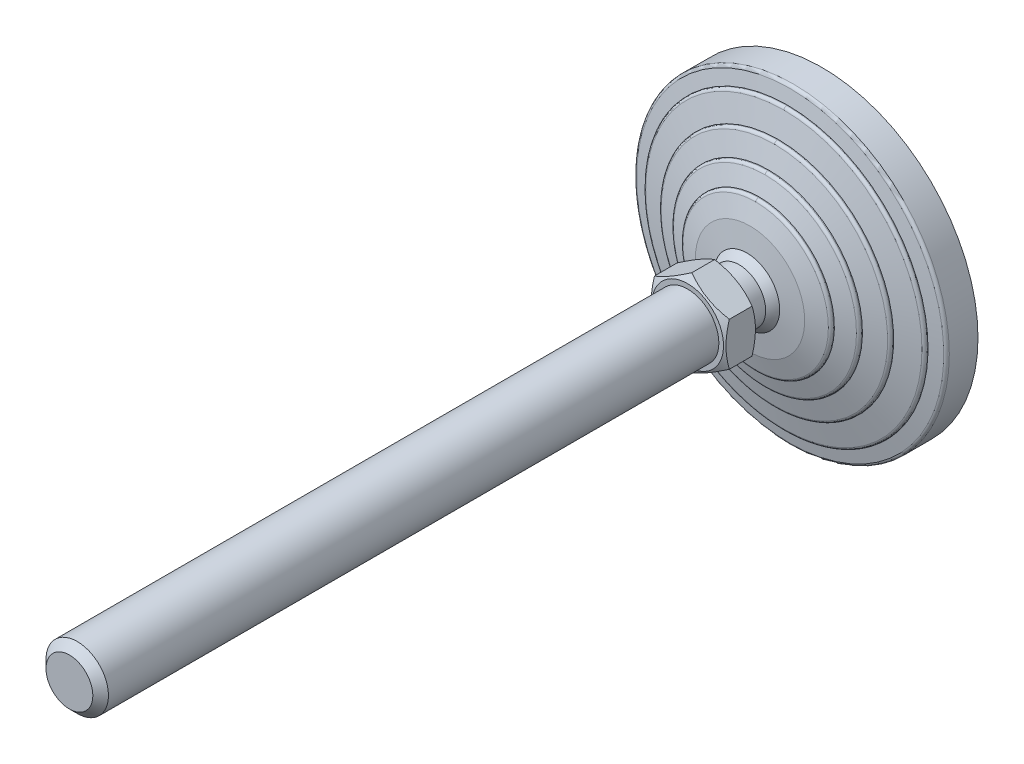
ISO-10303-21;
HEADER;
FILE_DESCRIPTION(('STEP AP214'),'2;1');
FILE_NAME('part.step','',(''),(''),'','','');
FILE_SCHEMA(('AUTOMOTIVE_DESIGN { 1 0 10303 214 1 1 1 1 }'));
ENDSEC;
DATA;
#1=APPLICATION_CONTEXT('core data for automotive mechanical design processes');
#2=APPLICATION_PROTOCOL_DEFINITION('international standard','automotive_design',2000,#1);
#3=PRODUCT_CONTEXT('',#1,'mechanical');
#4=PRODUCT('Part','Part','',(#3));
#5=PRODUCT_RELATED_PRODUCT_CATEGORY('part','',(#4));
#6=PRODUCT_DEFINITION_FORMATION('','',#4);
#7=PRODUCT_DEFINITION_CONTEXT('part definition',#1,'design');
#8=PRODUCT_DEFINITION('design','',#6,#7);
#9=PRODUCT_DEFINITION_SHAPE('','',#8);
#10=(LENGTH_UNIT() NAMED_UNIT(*) SI_UNIT(.MILLI.,.METRE.));
#11=(NAMED_UNIT(*) PLANE_ANGLE_UNIT() SI_UNIT($,.RADIAN.));
#12=(NAMED_UNIT(*) SI_UNIT($,.STERADIAN.) SOLID_ANGLE_UNIT());
#13=UNCERTAINTY_MEASURE_WITH_UNIT(LENGTH_MEASURE(1.E-05),#10,'distance_accuracy_value','');
#14=(GEOMETRIC_REPRESENTATION_CONTEXT(3) GLOBAL_UNCERTAINTY_ASSIGNED_CONTEXT((#13)) GLOBAL_UNIT_ASSIGNED_CONTEXT((#10,
#11,#12)) REPRESENTATION_CONTEXT('',''));
#15=CARTESIAN_POINT('',(0.,0.,0.));
#16=DIRECTION('',(0.,0.,1.));
#17=DIRECTION('',(1.,0.,0.));
#18=AXIS2_PLACEMENT_3D('',#15,#16,#17);
#19=CARTESIAN_POINT('',(-50.774113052,50.6,0.));
#20=DIRECTION('',(0.,0.,1.));
#21=DIRECTION('',(0.,-1.,0.));
#22=AXIS2_PLACEMENT_3D('',#19,#20,#21);
#23=PLANE('',#22);
#24=CARTESIAN_POINT('',(0.,0.,0.));
#25=DIRECTION('',(0.,0.,-1.));
#26=DIRECTION('',(1.,0.,0.));
#27=AXIS2_PLACEMENT_3D('',#24,#25,#26);
#28=CIRCLE('',#27,50.);
#29=CARTESIAN_POINT('',(50.,0.,0.));
#30=VERTEX_POINT('',#29);
#31=EDGE_CURVE('E161',#30,#30,#28,.F.);
#32=ORIENTED_EDGE('',*,*,#31,.F.);
#33=EDGE_LOOP('',(#32));
#34=FACE_BOUND('',#33,.T.);
#35=ADVANCED_FACE('F14',(#34),#23,.F.);
#36=CARTESIAN_POINT('',(0.,0.,9.180196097));
#37=DIRECTION('',(0.,0.,-1.));
#38=DIRECTION('',(1.,0.,0.));
#39=AXIS2_PLACEMENT_3D('',#36,#37,#38);
#40=CYLINDRICAL_SURFACE('',#39,50.);
#41=CARTESIAN_POINT('',(0.,0.,9.180196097));
#42=DIRECTION('',(0.,0.,1.));
#43=DIRECTION('',(0.,-1.,0.));
#44=AXIS2_PLACEMENT_3D('',#41,#42,#43);
#45=CIRCLE('',#44,50.);
#46=CARTESIAN_POINT('',(0.,-50.,9.180196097));
#47=VERTEX_POINT('',#46);
#48=EDGE_CURVE('E163',#47,#47,#45,.T.);
#49=ORIENTED_EDGE('',*,*,#48,.F.);
#50=EDGE_LOOP('',(#49));
#51=FACE_BOUND('',#50,.T.);
#52=ORIENTED_EDGE('',*,*,#31,.T.);
#53=EDGE_LOOP('',(#52));
#54=FACE_BOUND('',#53,.T.);
#55=ADVANCED_FACE('F303',(#51,#54),#40,.T.);
#56=CARTESIAN_POINT('',(0.,0.,9.180196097));
#57=DIRECTION('',(0.,0.,-1.));
#58=DIRECTION('',(0.,1.,0.));
#59=AXIS2_PLACEMENT_3D('',#56,#57,#58);
#60=TOROIDAL_SURFACE('',#59,48.9999999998,1.0000000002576);
#61=CARTESIAN_POINT('',(0.,0.,10.1607767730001));
#62=DIRECTION('',(0.,0.,-1.));
#63=DIRECTION('',(0.,1.,0.));
#64=AXIS2_PLACEMENT_3D('',#61,#62,#63);
#65=CIRCLE('',#64,49.196116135);
#66=CARTESIAN_POINT('',(0.,49.196116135,10.160776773));
#67=VERTEX_POINT('',#66);
#68=EDGE_CURVE('E167',#67,#67,#65,.F.);
#69=ORIENTED_EDGE('',*,*,#68,.F.);
#70=EDGE_LOOP('',(#69));
#71=FACE_BOUND('',#70,.T.);
#72=ORIENTED_EDGE('',*,*,#48,.T.);
#73=EDGE_LOOP('',(#72));
#74=FACE_BOUND('',#73,.T.);
#75=ADVANCED_FACE('F299',(#71,#74),#60,.T.);
#76=CARTESIAN_POINT('',(0.,0.,11.));
#77=DIRECTION('',(0.,0.,-1.));
#78=DIRECTION('',(0.,1.,0.));
#79=AXIS2_PLACEMENT_3D('',#76,#77,#78);
#80=CONICAL_SURFACE('',#79,45.,1.37340076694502);
#81=CARTESIAN_POINT('',(0.,0.,11.));
#82=DIRECTION('',(0.,0.,-1.));
#83=DIRECTION('',(0.,1.,0.));
#84=AXIS2_PLACEMENT_3D('',#81,#82,#83);
#85=CIRCLE('',#84,45.);
#86=CARTESIAN_POINT('',(0.,45.,11.));
#87=VERTEX_POINT('',#86);
#88=EDGE_CURVE('E854',#87,#87,#85,.F.);
#89=ORIENTED_EDGE('',*,*,#88,.F.);
#90=EDGE_LOOP('',(#89));
#91=FACE_BOUND('',#90,.T.);
#92=ORIENTED_EDGE('',*,*,#68,.T.);
#93=EDGE_LOOP('',(#92));
#94=FACE_BOUND('',#93,.T.);
#95=ADVANCED_FACE('F302',(#91,#94),#80,.T.);
#96=CARTESIAN_POINT('',(0.,0.,11.219223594));
#97=DIRECTION('',(0.,0.,-1.));
#98=DIRECTION('',(0.,1.,0.));
#99=AXIS2_PLACEMENT_3D('',#96,#97,#98);
#100=CYLINDRICAL_SURFACE('',#99,45.);
#101=CARTESIAN_POINT('',(0.,0.,11.219223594));
#102=DIRECTION('',(0.,0.,1.));
#103=DIRECTION('',(0.,-1.,0.));
#104=AXIS2_PLACEMENT_3D('',#101,#102,#103);
#105=CIRCLE('',#104,45.);
#106=CARTESIAN_POINT('',(-6.92225628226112E-09,-45.,11.219223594));
#107=VERTEX_POINT('',#106);
#108=CARTESIAN_POINT('',(-2.02037220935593E-09,45.,11.219223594));
#109=VERTEX_POINT('',#108);
#110=EDGE_CURVE('E845',#107,#109,#105,.T.);
#111=ORIENTED_EDGE('',*,*,#110,.F.);
#112=CARTESIAN_POINT('',(0.,0.,11.219223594));
#113=DIRECTION('',(0.,0.,1.));
#114=DIRECTION('',(0.,-1.,0.));
#115=AXIS2_PLACEMENT_3D('',#112,#113,#114);
#116=CIRCLE('',#115,45.);
#117=EDGE_CURVE('E825',#109,#107,#116,.T.);
#118=ORIENTED_EDGE('',*,*,#117,.F.);
#119=EDGE_LOOP('',(#111,#118));
#120=FACE_BOUND('',#119,.T.);
#121=ORIENTED_EDGE('',*,*,#88,.T.);
#122=EDGE_LOOP('',(#121));
#123=FACE_BOUND('',#122,.T.);
#124=ADVANCED_FACE('F433',(#120,#123),#100,.T.);
#125=CARTESIAN_POINT('',(0.,45.,11.219223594));
#126=CARTESIAN_POINT('',(90.0000000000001,45.,11.2192235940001));
#127=CARTESIAN_POINT('',(90.0000000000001,-45.,11.2192235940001));
#128=CARTESIAN_POINT('',(0.,-45.,11.219223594));
#129=CARTESIAN_POINT('',(0.,45.,11.696951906));
#130=CARTESIAN_POINT('',(90.0000000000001,45.,11.6969519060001));
#131=CARTESIAN_POINT('',(90.0000000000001,-45.,11.6969519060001));
#132=CARTESIAN_POINT('',(0.,-45.,11.696951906));
#133=CARTESIAN_POINT('',(0.,44.706000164,12.073499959));
#134=CARTESIAN_POINT('',(89.412000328,44.706000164,12.0734999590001));
#135=CARTESIAN_POINT('',(89.412000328,-44.706000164,12.0734999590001));
#136=CARTESIAN_POINT('',(0.,-44.706000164,12.073499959));
#137=CARTESIAN_POINT('',(0.,44.242535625,12.189366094));
#138=CARTESIAN_POINT('',(88.4850712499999,44.2425356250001,12.1893660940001));
#139=CARTESIAN_POINT('',(88.4850712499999,-44.2425356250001,12.1893660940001));
#140=CARTESIAN_POINT('',(0.,-44.242535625,12.189366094));
#141=(BOUNDED_SURFACE() B_SPLINE_SURFACE(3,3,((#125,#126,#127,#128),(#129,#130,#131,#132),(#133,
#134,#135,#136),(#137,#138,#139,#140)),.UNSPECIFIED.,.F.,.F.,
.F.) B_SPLINE_SURFACE_WITH_KNOTS((4,4),(4,4),(0.,1.),(0.,1.),
.UNSPECIFIED.) GEOMETRIC_REPRESENTATION_ITEM() RATIONAL_B_SPLINE_SURFACE(((1.,0.333333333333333,
0.333333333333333,1.),(0.858803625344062,0.286267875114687,0.286267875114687,0.858803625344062),
(0.858803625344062,0.286267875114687,0.286267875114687,0.858803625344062),(1.,0.333333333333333,
0.333333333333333,1.))) REPRESENTATION_ITEM('') SURFACE());
#142=CARTESIAN_POINT('',(0.,45.,11.219223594));
#143=CARTESIAN_POINT('',(0.,45.,11.696951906));
#144=CARTESIAN_POINT('',(0.,44.706000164,12.073499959));
#145=CARTESIAN_POINT('',(0.,44.242535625,12.189366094));
#146=(BOUNDED_CURVE() B_SPLINE_CURVE(3,(#142,#143,#144,#145),.UNSPECIFIED.,.F.,
.F.) B_SPLINE_CURVE_WITH_KNOTS((4,4),(0.,1.),
.UNSPECIFIED.) CURVE() GEOMETRIC_REPRESENTATION_ITEM() RATIONAL_B_SPLINE_CURVE((1.,
0.858803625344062,0.858803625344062,1.)) REPRESENTATION_ITEM(''));
#147=CARTESIAN_POINT('',(-5.95906362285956E-09,44.242535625,12.189366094));
#148=VERTEX_POINT('',#147);
#149=EDGE_CURVE('E832',#148,#109,#146,.F.);
#150=CARTESIAN_POINT('',(0.,0.,12.189366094));
#151=DIRECTION('',(0.,0.,-1.));
#152=DIRECTION('',(0.,1.,0.));
#153=AXIS2_PLACEMENT_3D('',#150,#151,#152);
#154=CIRCLE('',#153,44.242535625);
#155=CARTESIAN_POINT('',(-1.13428865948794E-08,-44.242535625,12.189366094));
#156=VERTEX_POINT('',#155);
#157=EDGE_CURVE('E822',#156,#148,#154,.F.);
#158=CARTESIAN_POINT('',(0.,-45.,11.219223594));
#159=CARTESIAN_POINT('',(0.,-45.,11.696951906));
#160=CARTESIAN_POINT('',(0.,-44.706000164,12.073499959));
#161=CARTESIAN_POINT('',(0.,-44.242535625,12.189366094));
#162=(BOUNDED_CURVE() B_SPLINE_CURVE(3,(#158,#159,#160,#161),.UNSPECIFIED.,.F.,
.F.) B_SPLINE_CURVE_WITH_KNOTS((4,4),(0.,1.),
.UNSPECIFIED.) CURVE() GEOMETRIC_REPRESENTATION_ITEM() RATIONAL_B_SPLINE_CURVE((1.,
0.858803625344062,0.858803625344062,1.)) REPRESENTATION_ITEM(''));
#163=EDGE_CURVE('E835',#107,#156,#162,.T.);
#164=ORIENTED_EDGE('',*,*,#110,.T.);
#165=ORIENTED_EDGE('',*,*,#149,.F.);
#166=ORIENTED_EDGE('',*,*,#157,.F.);
#167=ORIENTED_EDGE('',*,*,#163,.F.);
#168=EDGE_LOOP('',(#164,#165,#166,#167));
#169=FACE_BOUND('',#168,.T.);
#170=ADVANCED_FACE('F422',(#169),#141,.T.);
#171=CARTESIAN_POINT('',(0.,-45.,11.219223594));
#172=CARTESIAN_POINT('',(-90.0000000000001,-45.,11.2192235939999));
#173=CARTESIAN_POINT('',(-90.0000000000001,45.,11.2192235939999));
#174=CARTESIAN_POINT('',(0.,45.,11.219223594));
#175=CARTESIAN_POINT('',(0.,-45.,11.696951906));
#176=CARTESIAN_POINT('',(-90.0000000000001,-45.,11.6969519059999));
#177=CARTESIAN_POINT('',(-90.0000000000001,45.,11.6969519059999));
#178=CARTESIAN_POINT('',(0.,45.,11.696951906));
#179=CARTESIAN_POINT('',(0.,-44.706000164,12.073499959));
#180=CARTESIAN_POINT('',(-89.412000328,-44.706000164,12.0734999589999));
#181=CARTESIAN_POINT('',(-89.412000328,44.706000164,12.0734999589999));
#182=CARTESIAN_POINT('',(0.,44.706000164,12.073499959));
#183=CARTESIAN_POINT('',(0.,-44.242535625,12.189366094));
#184=CARTESIAN_POINT('',(-88.4850712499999,-44.2425356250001,12.1893660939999));
#185=CARTESIAN_POINT('',(-88.4850712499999,44.2425356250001,12.1893660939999));
#186=CARTESIAN_POINT('',(0.,44.242535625,12.189366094));
#187=(BOUNDED_SURFACE() B_SPLINE_SURFACE(3,3,((#171,#172,#173,#174),(#175,#176,#177,#178),(#179,
#180,#181,#182),(#183,#184,#185,#186)),.UNSPECIFIED.,.F.,.F.,
.F.) B_SPLINE_SURFACE_WITH_KNOTS((4,4),(4,4),(0.,1.),(0.,1.),
.UNSPECIFIED.) GEOMETRIC_REPRESENTATION_ITEM() RATIONAL_B_SPLINE_SURFACE(((1.,0.333333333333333,
0.333333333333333,1.),(0.858803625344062,0.286267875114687,0.286267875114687,0.858803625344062),
(0.858803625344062,0.286267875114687,0.286267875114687,0.858803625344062),(1.,0.333333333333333,
0.333333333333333,1.))) REPRESENTATION_ITEM('') SURFACE());
#188=CARTESIAN_POINT('',(0.,0.,12.189366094));
#189=DIRECTION('',(0.,0.,-1.));
#190=DIRECTION('',(0.,1.,0.));
#191=AXIS2_PLACEMENT_3D('',#188,#189,#190);
#192=CIRCLE('',#191,44.242535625);
#193=EDGE_CURVE('E821',#148,#156,#192,.F.);
#194=ORIENTED_EDGE('',*,*,#149,.T.);
#195=ORIENTED_EDGE('',*,*,#117,.T.);
#196=ORIENTED_EDGE('',*,*,#163,.T.);
#197=ORIENTED_EDGE('',*,*,#193,.F.);
#198=EDGE_LOOP('',(#194,#195,#196,#197));
#199=FACE_BOUND('',#198,.T.);
#200=ADVANCED_FACE('F416',(#199),#187,.T.);
#201=CARTESIAN_POINT('',(0.,0.,14.));
#202=DIRECTION('',(0.,0.,-1.));
#203=DIRECTION('',(1.,0.,0.));
#204=AXIS2_PLACEMENT_3D('',#201,#202,#203);
#205=CONICAL_SURFACE('',#204,37.,1.32581766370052);
#206=CARTESIAN_POINT('',(0.,0.,14.));
#207=DIRECTION('',(0.,0.,-1.));
#208=DIRECTION('',(0.,1.,0.));
#209=AXIS2_PLACEMENT_3D('',#206,#207,#208);
#210=CIRCLE('',#209,37.);
#211=CARTESIAN_POINT('',(0.,37.,14.));
#212=VERTEX_POINT('',#211);
#213=EDGE_CURVE('E812',#212,#212,#210,.F.);
#214=ORIENTED_EDGE('',*,*,#213,.F.);
#215=EDGE_LOOP('',(#214));
#216=FACE_BOUND('',#215,.T.);
#217=ORIENTED_EDGE('',*,*,#193,.T.);
#218=ORIENTED_EDGE('',*,*,#157,.T.);
#219=EDGE_LOOP('',(#217,#218));
#220=FACE_BOUND('',#219,.T.);
#221=ADVANCED_FACE('F412',(#216,#220),#205,.T.);
#222=CARTESIAN_POINT('',(0.,0.,14.245698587));
#223=DIRECTION('',(0.,0.,-1.));
#224=DIRECTION('',(1.,0.,0.));
#225=AXIS2_PLACEMENT_3D('',#222,#223,#224);
#226=CYLINDRICAL_SURFACE('',#225,37.);
#227=CARTESIAN_POINT('',(0.,0.,14.245698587));
#228=DIRECTION('',(0.,0.,1.));
#229=DIRECTION('',(0.,-1.,0.));
#230=AXIS2_PLACEMENT_3D('',#227,#228,#229);
#231=CIRCLE('',#230,37.);
#232=CARTESIAN_POINT('',(-5.69163991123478E-09,-37.,14.245698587));
#233=VERTEX_POINT('',#232);
#234=CARTESIAN_POINT('',(-1.66120189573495E-09,37.,14.245698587));
#235=VERTEX_POINT('',#234);
#236=EDGE_CURVE('E803',#233,#235,#231,.T.);
#237=ORIENTED_EDGE('',*,*,#236,.F.);
#238=CARTESIAN_POINT('',(0.,0.,14.245698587));
#239=DIRECTION('',(0.,0.,1.));
#240=DIRECTION('',(0.,-1.,0.));
#241=AXIS2_PLACEMENT_3D('',#238,#239,#240);
#242=CIRCLE('',#241,37.);
#243=EDGE_CURVE('E783',#235,#233,#242,.T.);
#244=ORIENTED_EDGE('',*,*,#243,.F.);
#245=EDGE_LOOP('',(#237,#244));
#246=FACE_BOUND('',#245,.T.);
#247=ORIENTED_EDGE('',*,*,#213,.T.);
#248=EDGE_LOOP('',(#247));
#249=FACE_BOUND('',#248,.T.);
#250=ADVANCED_FACE('F403',(#246,#249),#226,.T.);
#251=CARTESIAN_POINT('',(0.,37.,14.245698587));
#252=CARTESIAN_POINT('',(74.,37.,14.2456985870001));
#253=CARTESIAN_POINT('',(74.,-37.,14.2456985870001));
#254=CARTESIAN_POINT('',(0.,-37.,14.245698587));
#255=CARTESIAN_POINT('',(0.,37.,14.709515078));
#256=CARTESIAN_POINT('',(74.,37.,14.7095150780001));
#257=CARTESIAN_POINT('',(74.,-37.,14.7095150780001));
#258=CARTESIAN_POINT('',(0.,-37.,14.709515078));
#259=CARTESIAN_POINT('',(0.,36.720691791,15.079802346));
#260=CARTESIAN_POINT('',(73.441383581,36.720691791,15.0798023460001));
#261=CARTESIAN_POINT('',(73.441383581,-36.720691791,15.0798023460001));
#262=CARTESIAN_POINT('',(0.,-36.720691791,15.079802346));
#263=CARTESIAN_POINT('',(0.,36.274721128,15.207222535));
#264=CARTESIAN_POINT('',(72.549442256,36.274721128,15.2072225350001));
#265=CARTESIAN_POINT('',(72.549442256,-36.274721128,15.2072225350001));
#266=CARTESIAN_POINT('',(0.,-36.274721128,15.207222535));
#267=(BOUNDED_SURFACE() B_SPLINE_SURFACE(3,3,((#251,#252,#253,#254),(#255,#256,#257,#258),(#259,
#260,#261,#262),(#263,#264,#265,#266)),.UNSPECIFIED.,.F.,.F.,
.F.) B_SPLINE_SURFACE_WITH_KNOTS((4,4),(4,4),(0.,1.),(0.,1.),
.UNSPECIFIED.) GEOMETRIC_REPRESENTATION_ITEM() RATIONAL_B_SPLINE_SURFACE(((1.,0.333333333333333,
0.333333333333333,1.),(0.865565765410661,0.288521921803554,0.288521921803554,0.865565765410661),
(0.865565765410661,0.288521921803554,0.288521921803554,0.865565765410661),(1.,0.333333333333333,
0.333333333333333,1.))) REPRESENTATION_ITEM('') SURFACE());
#268=CARTESIAN_POINT('',(0.,37.,14.245698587));
#269=CARTESIAN_POINT('',(0.,37.,14.709515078));
#270=CARTESIAN_POINT('',(0.,36.720691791,15.079802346));
#271=CARTESIAN_POINT('',(0.,36.274721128,15.207222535));
#272=(BOUNDED_CURVE() B_SPLINE_CURVE(3,(#268,#269,#270,#271),.UNSPECIFIED.,.F.,
.F.) B_SPLINE_CURVE_WITH_KNOTS((4,4),(0.,1.),
.UNSPECIFIED.) CURVE() GEOMETRIC_REPRESENTATION_ITEM() RATIONAL_B_SPLINE_CURVE((1.,
0.865565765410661,0.865565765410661,1.)) REPRESENTATION_ITEM(''));
#273=CARTESIAN_POINT('',(-4.885879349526E-09,36.274721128,15.2072225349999));
#274=VERTEX_POINT('',#273);
#275=EDGE_CURVE('E790',#274,#235,#272,.F.);
#276=CARTESIAN_POINT('',(0.,0.,15.2072225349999));
#277=DIRECTION('',(0.,0.,-1.));
#278=DIRECTION('',(0.,1.,0.));
#279=AXIS2_PLACEMENT_3D('',#276,#277,#278);
#280=CIRCLE('',#279,36.274721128);
#281=CARTESIAN_POINT('',(-9.30010819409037E-09,-36.274721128,15.2072225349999));
#282=VERTEX_POINT('',#281);
#283=EDGE_CURVE('E780',#282,#274,#280,.F.);
#284=CARTESIAN_POINT('',(0.,-37.,14.245698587));
#285=CARTESIAN_POINT('',(0.,-37.,14.709515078));
#286=CARTESIAN_POINT('',(0.,-36.720691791,15.079802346));
#287=CARTESIAN_POINT('',(0.,-36.274721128,15.207222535));
#288=(BOUNDED_CURVE() B_SPLINE_CURVE(3,(#284,#285,#286,#287),.UNSPECIFIED.,.F.,
.F.) B_SPLINE_CURVE_WITH_KNOTS((4,4),(0.,1.),
.UNSPECIFIED.) CURVE() GEOMETRIC_REPRESENTATION_ITEM() RATIONAL_B_SPLINE_CURVE((1.,
0.865565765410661,0.865565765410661,1.)) REPRESENTATION_ITEM(''));
#289=EDGE_CURVE('E793',#233,#282,#288,.T.);
#290=ORIENTED_EDGE('',*,*,#236,.T.);
#291=ORIENTED_EDGE('',*,*,#275,.F.);
#292=ORIENTED_EDGE('',*,*,#283,.F.);
#293=ORIENTED_EDGE('',*,*,#289,.F.);
#294=EDGE_LOOP('',(#290,#291,#292,#293));
#295=FACE_BOUND('',#294,.T.);
#296=ADVANCED_FACE('F392',(#295),#267,.T.);
#297=CARTESIAN_POINT('',(0.,-37.,14.245698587));
#298=CARTESIAN_POINT('',(-74.,-37.,14.2456985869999));
#299=CARTESIAN_POINT('',(-74.,37.,14.2456985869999));
#300=CARTESIAN_POINT('',(0.,37.,14.245698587));
#301=CARTESIAN_POINT('',(0.,-37.,14.709515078));
#302=CARTESIAN_POINT('',(-74.,-37.,14.7095150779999));
#303=CARTESIAN_POINT('',(-74.,37.,14.7095150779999));
#304=CARTESIAN_POINT('',(0.,37.,14.709515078));
#305=CARTESIAN_POINT('',(0.,-36.720691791,15.079802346));
#306=CARTESIAN_POINT('',(-73.441383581,-36.720691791,15.0798023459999));
#307=CARTESIAN_POINT('',(-73.441383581,36.720691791,15.0798023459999));
#308=CARTESIAN_POINT('',(0.,36.720691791,15.079802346));
#309=CARTESIAN_POINT('',(0.,-36.274721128,15.207222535));
#310=CARTESIAN_POINT('',(-72.549442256,-36.274721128,15.2072225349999));
#311=CARTESIAN_POINT('',(-72.549442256,36.274721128,15.2072225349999));
#312=CARTESIAN_POINT('',(0.,36.274721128,15.207222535));
#313=(BOUNDED_SURFACE() B_SPLINE_SURFACE(3,3,((#297,#298,#299,#300),(#301,#302,#303,#304),(#305,
#306,#307,#308),(#309,#310,#311,#312)),.UNSPECIFIED.,.F.,.F.,
.F.) B_SPLINE_SURFACE_WITH_KNOTS((4,4),(4,4),(0.,1.),(0.,1.),
.UNSPECIFIED.) GEOMETRIC_REPRESENTATION_ITEM() RATIONAL_B_SPLINE_SURFACE(((1.,0.333333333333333,
0.333333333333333,1.),(0.865565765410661,0.288521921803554,0.288521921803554,0.865565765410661),
(0.865565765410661,0.288521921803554,0.288521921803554,0.865565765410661),(1.,0.333333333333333,
0.333333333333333,1.))) REPRESENTATION_ITEM('') SURFACE());
#314=CARTESIAN_POINT('',(0.,0.,15.2072225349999));
#315=DIRECTION('',(0.,0.,-1.));
#316=DIRECTION('',(0.,1.,0.));
#317=AXIS2_PLACEMENT_3D('',#314,#315,#316);
#318=CIRCLE('',#317,36.274721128);
#319=EDGE_CURVE('E779',#274,#282,#318,.F.);
#320=ORIENTED_EDGE('',*,*,#275,.T.);
#321=ORIENTED_EDGE('',*,*,#243,.T.);
#322=ORIENTED_EDGE('',*,*,#289,.T.);
#323=ORIENTED_EDGE('',*,*,#319,.F.);
#324=EDGE_LOOP('',(#320,#321,#322,#323));
#325=FACE_BOUND('',#324,.T.);
#326=ADVANCED_FACE('F386',(#325),#313,.T.);
#327=CARTESIAN_POINT('',(0.,0.,17.));
#328=DIRECTION('',(0.,0.,-1.));
#329=DIRECTION('',(0.,1.,0.));
#330=AXIS2_PLACEMENT_3D('',#327,#328,#329);
#331=CONICAL_SURFACE('',#330,30.,1.29249666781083);
#332=CARTESIAN_POINT('',(0.,0.,17.));
#333=DIRECTION('',(0.,0.,-1.));
#334=DIRECTION('',(0.,1.,0.));
#335=AXIS2_PLACEMENT_3D('',#332,#333,#334);
#336=CIRCLE('',#335,30.);
#337=CARTESIAN_POINT('',(0.,30.,17.));
#338=VERTEX_POINT('',#337);
#339=EDGE_CURVE('E770',#338,#338,#336,.F.);
#340=ORIENTED_EDGE('',*,*,#339,.F.);
#341=EDGE_LOOP('',(#340));
#342=FACE_BOUND('',#341,.T.);
#343=ORIENTED_EDGE('',*,*,#319,.T.);
#344=ORIENTED_EDGE('',*,*,#283,.T.);
#345=EDGE_LOOP('',(#343,#344));
#346=FACE_BOUND('',#345,.T.);
#347=ADVANCED_FACE('F382',(#342,#346),#331,.T.);
#348=CARTESIAN_POINT('',(0.,0.,17.27924078));
#349=DIRECTION('',(0.,0.,-1.));
#350=DIRECTION('',(0.,1.,0.));
#351=AXIS2_PLACEMENT_3D('',#348,#349,#350);
#352=CYLINDRICAL_SURFACE('',#351,30.);
#353=CARTESIAN_POINT('',(0.,0.,17.27924078));
#354=DIRECTION('',(0.,0.,1.));
#355=DIRECTION('',(0.,-1.,0.));
#356=AXIS2_PLACEMENT_3D('',#353,#354,#355);
#357=CIRCLE('',#356,30.);
#358=CARTESIAN_POINT('',(-4.61485112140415E-09,-30.,17.27924078));
#359=VERTEX_POINT('',#358);
#360=CARTESIAN_POINT('',(-1.34692840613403E-09,30.,17.27924078));
#361=VERTEX_POINT('',#360);
#362=EDGE_CURVE('E761',#359,#361,#357,.T.);
#363=ORIENTED_EDGE('',*,*,#362,.F.);
#364=CARTESIAN_POINT('',(0.,0.,17.27924078));
#365=DIRECTION('',(0.,0.,1.));
#366=DIRECTION('',(0.,-1.,0.));
#367=AXIS2_PLACEMENT_3D('',#364,#365,#366);
#368=CIRCLE('',#367,30.);
#369=EDGE_CURVE('E741',#361,#359,#368,.T.);
#370=ORIENTED_EDGE('',*,*,#369,.F.);
#371=EDGE_LOOP('',(#363,#370));
#372=FACE_BOUND('',#371,.T.);
#373=ORIENTED_EDGE('',*,*,#339,.T.);
#374=EDGE_LOOP('',(#373));
#375=FACE_BOUND('',#374,.T.);
#376=ADVANCED_FACE('F373',(#372,#375),#352,.T.);
#377=CARTESIAN_POINT('',(0.,30.,17.27924078));
#378=CARTESIAN_POINT('',(60.0000000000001,30.,17.2792407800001));
#379=CARTESIAN_POINT('',(60.0000000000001,-30.,17.2792407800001));
#380=CARTESIAN_POINT('',(0.,-30.,17.27924078));
#381=CARTESIAN_POINT('',(0.,30.,17.725161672));
#382=CARTESIAN_POINT('',(60.0000000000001,30.,17.7251616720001));
#383=CARTESIAN_POINT('',(60.0000000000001,-30.,17.7251616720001));
#384=CARTESIAN_POINT('',(0.,-30.,17.725161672));
#385=CARTESIAN_POINT('',(0.,29.739265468,18.086911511));
#386=CARTESIAN_POINT('',(59.4785309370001,29.739265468,18.0869115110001));
#387=CARTESIAN_POINT('',(59.4785309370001,-29.739265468,18.0869115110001));
#388=CARTESIAN_POINT('',(0.,-29.739265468,18.086911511));
#389=CARTESIAN_POINT('',(0.,29.316227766,18.227924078));
#390=CARTESIAN_POINT('',(58.6324555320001,29.316227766,18.2279240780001));
#391=CARTESIAN_POINT('',(58.6324555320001,-29.316227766,18.2279240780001));
#392=CARTESIAN_POINT('',(0.,-29.316227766,18.227924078));
#393=(BOUNDED_SURFACE() B_SPLINE_SURFACE(3,3,((#377,#378,#379,#380),(#381,#382,#383,#384),(#385,
#386,#387,#388),(#389,#390,#391,#392)),.UNSPECIFIED.,.F.,.F.,
.F.) B_SPLINE_SURFACE_WITH_KNOTS((4,4),(4,4),(0.,1.),(0.,1.),
.UNSPECIFIED.) GEOMETRIC_REPRESENTATION_ITEM() RATIONAL_B_SPLINE_SURFACE(((1.,0.333333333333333,
0.333333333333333,1.),(0.874161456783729,0.291387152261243,0.291387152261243,0.874161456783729),
(0.874161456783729,0.291387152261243,0.291387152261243,0.874161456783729),(1.,0.333333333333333,
0.333333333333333,1.))) REPRESENTATION_ITEM('') SURFACE());
#394=CARTESIAN_POINT('',(0.,30.,17.27924078));
#395=CARTESIAN_POINT('',(0.,30.,17.725161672));
#396=CARTESIAN_POINT('',(0.,29.739265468,18.086911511));
#397=CARTESIAN_POINT('',(0.,29.316227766,18.227924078));
#398=(BOUNDED_CURVE() B_SPLINE_CURVE(3,(#394,#395,#396,#397),.UNSPECIFIED.,.F.,
.F.) B_SPLINE_CURVE_WITH_KNOTS((4,4),(0.,1.),
.UNSPECIFIED.) CURVE() GEOMETRIC_REPRESENTATION_ITEM() RATIONAL_B_SPLINE_CURVE((1.,
0.874161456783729,0.874161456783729,1.)) REPRESENTATION_ITEM(''));
#399=CARTESIAN_POINT('',(-3.94864099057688E-09,29.3162277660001,18.2279240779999));
#400=VERTEX_POINT('',#399);
#401=EDGE_CURVE('E748',#400,#361,#398,.F.);
#402=CARTESIAN_POINT('',(0.,0.,18.2279240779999));
#403=DIRECTION('',(0.,0.,-1.));
#404=DIRECTION('',(0.,1.,0.));
#405=AXIS2_PLACEMENT_3D('',#402,#403,#404);
#406=CIRCLE('',#405,29.316227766);
#407=CARTESIAN_POINT('',(-7.51609882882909E-09,-29.3162277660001,18.2279240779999));
#408=VERTEX_POINT('',#407);
#409=EDGE_CURVE('E738',#408,#400,#406,.F.);
#410=CARTESIAN_POINT('',(0.,-30.,17.27924078));
#411=CARTESIAN_POINT('',(0.,-30.,17.725161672));
#412=CARTESIAN_POINT('',(0.,-29.739265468,18.086911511));
#413=CARTESIAN_POINT('',(0.,-29.316227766,18.227924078));
#414=(BOUNDED_CURVE() B_SPLINE_CURVE(3,(#410,#411,#412,#413),.UNSPECIFIED.,.F.,
.F.) B_SPLINE_CURVE_WITH_KNOTS((4,4),(0.,1.),
.UNSPECIFIED.) CURVE() GEOMETRIC_REPRESENTATION_ITEM() RATIONAL_B_SPLINE_CURVE((1.,
0.874161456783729,0.874161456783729,1.)) REPRESENTATION_ITEM(''));
#415=EDGE_CURVE('E751',#359,#408,#414,.T.);
#416=ORIENTED_EDGE('',*,*,#362,.T.);
#417=ORIENTED_EDGE('',*,*,#401,.F.);
#418=ORIENTED_EDGE('',*,*,#409,.F.);
#419=ORIENTED_EDGE('',*,*,#415,.F.);
#420=EDGE_LOOP('',(#416,#417,#418,#419));
#421=FACE_BOUND('',#420,.T.);
#422=ADVANCED_FACE('F362',(#421),#393,.T.);
#423=CARTESIAN_POINT('',(0.,-30.,17.27924078));
#424=CARTESIAN_POINT('',(-60.0000000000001,-30.,17.2792407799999));
#425=CARTESIAN_POINT('',(-60.0000000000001,30.,17.2792407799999));
#426=CARTESIAN_POINT('',(0.,30.,17.27924078));
#427=CARTESIAN_POINT('',(0.,-30.,17.725161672));
#428=CARTESIAN_POINT('',(-60.0000000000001,-30.,17.7251616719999));
#429=CARTESIAN_POINT('',(-60.0000000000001,30.,17.7251616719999));
#430=CARTESIAN_POINT('',(0.,30.,17.725161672));
#431=CARTESIAN_POINT('',(0.,-29.739265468,18.086911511));
#432=CARTESIAN_POINT('',(-59.4785309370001,-29.739265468,18.0869115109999));
#433=CARTESIAN_POINT('',(-59.4785309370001,29.739265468,18.0869115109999));
#434=CARTESIAN_POINT('',(0.,29.739265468,18.086911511));
#435=CARTESIAN_POINT('',(0.,-29.316227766,18.227924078));
#436=CARTESIAN_POINT('',(-58.6324555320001,-29.316227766,18.2279240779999));
#437=CARTESIAN_POINT('',(-58.6324555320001,29.316227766,18.2279240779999));
#438=CARTESIAN_POINT('',(0.,29.316227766,18.227924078));
#439=(BOUNDED_SURFACE() B_SPLINE_SURFACE(3,3,((#423,#424,#425,#426),(#427,#428,#429,#430),(#431,
#432,#433,#434),(#435,#436,#437,#438)),.UNSPECIFIED.,.F.,.F.,
.F.) B_SPLINE_SURFACE_WITH_KNOTS((4,4),(4,4),(0.,1.),(0.,1.),
.UNSPECIFIED.) GEOMETRIC_REPRESENTATION_ITEM() RATIONAL_B_SPLINE_SURFACE(((1.,0.333333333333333,
0.333333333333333,1.),(0.874161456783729,0.291387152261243,0.291387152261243,0.874161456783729),
(0.874161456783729,0.291387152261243,0.291387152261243,0.874161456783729),(1.,0.333333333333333,
0.333333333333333,1.))) REPRESENTATION_ITEM('') SURFACE());
#440=CARTESIAN_POINT('',(0.,0.,18.2279240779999));
#441=DIRECTION('',(0.,0.,-1.));
#442=DIRECTION('',(0.,1.,0.));
#443=AXIS2_PLACEMENT_3D('',#440,#441,#442);
#444=CIRCLE('',#443,29.316227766);
#445=EDGE_CURVE('E737',#400,#408,#444,.F.);
#446=ORIENTED_EDGE('',*,*,#401,.T.);
#447=ORIENTED_EDGE('',*,*,#369,.T.);
#448=ORIENTED_EDGE('',*,*,#415,.T.);
#449=ORIENTED_EDGE('',*,*,#445,.F.);
#450=EDGE_LOOP('',(#446,#447,#448,#449));
#451=FACE_BOUND('',#450,.T.);
#452=ADVANCED_FACE('F356',(#451),#439,.T.);
#453=CARTESIAN_POINT('',(0.,0.,20.));
#454=DIRECTION('',(0.,0.,-1.));
#455=DIRECTION('',(1.,0.,0.));
#456=AXIS2_PLACEMENT_3D('',#453,#454,#455);
#457=CONICAL_SURFACE('',#456,24.,1.24904577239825);
#458=CARTESIAN_POINT('',(0.,0.,20.));
#459=DIRECTION('',(0.,0.,-1.));
#460=DIRECTION('',(0.,1.,0.));
#461=AXIS2_PLACEMENT_3D('',#458,#459,#460);
#462=CIRCLE('',#461,24.);
#463=CARTESIAN_POINT('',(0.,24.,20.));
#464=VERTEX_POINT('',#463);
#465=EDGE_CURVE('E728',#464,#464,#462,.F.);
#466=ORIENTED_EDGE('',*,*,#465,.F.);
#467=EDGE_LOOP('',(#466));
#468=FACE_BOUND('',#467,.T.);
#469=ORIENTED_EDGE('',*,*,#445,.T.);
#470=ORIENTED_EDGE('',*,*,#409,.T.);
#471=EDGE_LOOP('',(#469,#470));
#472=FACE_BOUND('',#471,.T.);
#473=ADVANCED_FACE('F352',(#468,#472),#457,.T.);
#474=CARTESIAN_POINT('',(0.,0.,20.261425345));
#475=DIRECTION('',(0.,0.,-1.));
#476=DIRECTION('',(0.,1.,0.));
#477=AXIS2_PLACEMENT_3D('',#474,#475,#476);
#478=CYLINDRICAL_SURFACE('',#477,24.);
#479=CARTESIAN_POINT('',(0.,0.,20.261425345));
#480=DIRECTION('',(0.,0.,1.));
#481=DIRECTION('',(0.,-1.,0.));
#482=AXIS2_PLACEMENT_3D('',#479,#480,#481);
#483=CIRCLE('',#482,24.);
#484=CARTESIAN_POINT('',(-3.69188983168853E-09,-24.,20.261425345));
#485=VERTEX_POINT('',#484);
#486=CARTESIAN_POINT('',(-1.07755165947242E-09,24.,20.261425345));
#487=VERTEX_POINT('',#486);
#488=EDGE_CURVE('E719',#485,#487,#483,.T.);
#489=ORIENTED_EDGE('',*,*,#488,.F.);
#490=CARTESIAN_POINT('',(0.,0.,20.261425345));
#491=DIRECTION('',(0.,0.,1.));
#492=DIRECTION('',(0.,-1.,0.));
#493=AXIS2_PLACEMENT_3D('',#490,#491,#492);
#494=CIRCLE('',#493,24.);
#495=EDGE_CURVE('E699',#487,#485,#494,.T.);
#496=ORIENTED_EDGE('',*,*,#495,.F.);
#497=EDGE_LOOP('',(#489,#496));
#498=FACE_BOUND('',#497,.T.);
#499=ORIENTED_EDGE('',*,*,#465,.T.);
#500=EDGE_LOOP('',(#499));
#501=FACE_BOUND('',#500,.T.);
#502=ADVANCED_FACE('F343',(#498,#501),#478,.T.);
#503=CARTESIAN_POINT('',(0.,24.,20.261425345));
#504=CARTESIAN_POINT('',(48.,24.,20.2614253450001));
#505=CARTESIAN_POINT('',(48.,-24.,20.2614253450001));
#506=CARTESIAN_POINT('',(0.,-24.,20.261425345));
#507=CARTESIAN_POINT('',(0.,24.,20.716888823));
#508=CARTESIAN_POINT('',(48.,24.,20.7168888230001));
#509=CARTESIAN_POINT('',(48.,-24.,20.7168888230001));
#510=CARTESIAN_POINT('',(0.,-24.,20.716888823));
#511=CARTESIAN_POINT('',(0.,23.72940828,21.083258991));
#512=CARTESIAN_POINT('',(47.4588165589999,23.72940828,21.0832589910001));
#513=CARTESIAN_POINT('',(47.4588165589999,-23.72940828,21.0832589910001));
#514=CARTESIAN_POINT('',(0.,-23.72940828,21.083258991));
#515=CARTESIAN_POINT('',(0.,23.294085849,21.217204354));
#516=CARTESIAN_POINT('',(46.5881716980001,23.294085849,21.2172043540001));
#517=CARTESIAN_POINT('',(46.5881716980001,-23.294085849,21.2172043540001));
#518=CARTESIAN_POINT('',(0.,-23.294085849,21.217204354));
#519=(BOUNDED_SURFACE() B_SPLINE_SURFACE(3,3,((#503,#504,#505,#506),(#507,#508,#509,#510),(#511,
#512,#513,#514),(#515,#516,#517,#518)),.UNSPECIFIED.,.F.,.F.,
.F.) B_SPLINE_SURFACE_WITH_KNOTS((4,4),(4,4),(0.,1.),(0.,1.),
.UNSPECIFIED.) GEOMETRIC_REPRESENTATION_ITEM() RATIONAL_B_SPLINE_SURFACE(((1.,0.333333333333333,
0.333333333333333,1.),(0.869593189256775,0.289864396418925,0.289864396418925,0.869593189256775),
(0.869593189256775,0.289864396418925,0.289864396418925,0.869593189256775),(1.,0.333333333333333,
0.333333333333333,1.))) REPRESENTATION_ITEM('') SURFACE());
#520=CARTESIAN_POINT('',(0.,24.,20.261425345));
#521=CARTESIAN_POINT('',(0.,24.,20.716888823));
#522=CARTESIAN_POINT('',(0.,23.72940828,21.083258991));
#523=CARTESIAN_POINT('',(0.,23.294085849,21.217204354));
#524=(BOUNDED_CURVE() B_SPLINE_CURVE(3,(#520,#521,#522,#523),.UNSPECIFIED.,.F.,
.F.) B_SPLINE_CURVE_WITH_KNOTS((4,4),(0.,1.),
.UNSPECIFIED.) CURVE() GEOMETRIC_REPRESENTATION_ITEM() RATIONAL_B_SPLINE_CURVE((1.,
0.869593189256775,0.869593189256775,1.)) REPRESENTATION_ITEM(''));
#525=CARTESIAN_POINT('',(-3.13752017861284E-09,23.294085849,21.217204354));
#526=VERTEX_POINT('',#525);
#527=EDGE_CURVE('E706',#526,#487,#524,.F.);
#528=CARTESIAN_POINT('',(0.,0.,21.217204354));
#529=DIRECTION('',(0.,0.,-1.));
#530=DIRECTION('',(0.,1.,0.));
#531=AXIS2_PLACEMENT_3D('',#528,#529,#530);
#532=CIRCLE('',#531,23.294085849);
#533=CARTESIAN_POINT('',(-5.97215053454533E-09,-23.294085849,21.217204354));
#534=VERTEX_POINT('',#533);
#535=EDGE_CURVE('E696',#534,#526,#532,.F.);
#536=CARTESIAN_POINT('',(0.,-24.,20.261425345));
#537=CARTESIAN_POINT('',(0.,-24.,20.716888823));
#538=CARTESIAN_POINT('',(0.,-23.72940828,21.083258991));
#539=CARTESIAN_POINT('',(0.,-23.294085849,21.217204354));
#540=(BOUNDED_CURVE() B_SPLINE_CURVE(3,(#536,#537,#538,#539),.UNSPECIFIED.,.F.,
.F.) B_SPLINE_CURVE_WITH_KNOTS((4,4),(0.,1.),
.UNSPECIFIED.) CURVE() GEOMETRIC_REPRESENTATION_ITEM() RATIONAL_B_SPLINE_CURVE((1.,
0.869593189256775,0.869593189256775,1.)) REPRESENTATION_ITEM(''));
#541=EDGE_CURVE('E709',#485,#534,#540,.T.);
#542=ORIENTED_EDGE('',*,*,#488,.T.);
#543=ORIENTED_EDGE('',*,*,#527,.F.);
#544=ORIENTED_EDGE('',*,*,#535,.F.);
#545=ORIENTED_EDGE('',*,*,#541,.F.);
#546=EDGE_LOOP('',(#542,#543,#544,#545));
#547=FACE_BOUND('',#546,.T.);
#548=ADVANCED_FACE('F332',(#547),#519,.T.);
#549=CARTESIAN_POINT('',(0.,-24.,20.261425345));
#550=CARTESIAN_POINT('',(-48.,-24.,20.261425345));
#551=CARTESIAN_POINT('',(-48.,24.,20.261425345));
#552=CARTESIAN_POINT('',(0.,24.,20.261425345));
#553=CARTESIAN_POINT('',(0.,-24.,20.716888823));
#554=CARTESIAN_POINT('',(-48.,-24.,20.7168888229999));
#555=CARTESIAN_POINT('',(-48.,24.,20.7168888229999));
#556=CARTESIAN_POINT('',(0.,24.,20.716888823));
#557=CARTESIAN_POINT('',(0.,-23.72940828,21.083258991));
#558=CARTESIAN_POINT('',(-47.458816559,-23.72940828,21.0832589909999));
#559=CARTESIAN_POINT('',(-47.458816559,23.72940828,21.0832589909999));
#560=CARTESIAN_POINT('',(0.,23.72940828,21.083258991));
#561=CARTESIAN_POINT('',(0.,-23.294085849,21.217204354));
#562=CARTESIAN_POINT('',(-46.5881716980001,-23.294085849,21.2172043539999));
#563=CARTESIAN_POINT('',(-46.5881716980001,23.294085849,21.2172043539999));
#564=CARTESIAN_POINT('',(0.,23.294085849,21.217204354));
#565=(BOUNDED_SURFACE() B_SPLINE_SURFACE(3,3,((#549,#550,#551,#552),(#553,#554,#555,#556),(#557,
#558,#559,#560),(#561,#562,#563,#564)),.UNSPECIFIED.,.F.,.F.,
.F.) B_SPLINE_SURFACE_WITH_KNOTS((4,4),(4,4),(0.,1.),(0.,1.),
.UNSPECIFIED.) GEOMETRIC_REPRESENTATION_ITEM() RATIONAL_B_SPLINE_SURFACE(((1.,0.333333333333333,
0.333333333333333,1.),(0.869593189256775,0.289864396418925,0.289864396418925,0.869593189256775),
(0.869593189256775,0.289864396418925,0.289864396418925,0.869593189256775),(1.,0.333333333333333,
0.333333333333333,1.))) REPRESENTATION_ITEM('') SURFACE());
#566=CARTESIAN_POINT('',(0.,0.,21.217204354));
#567=DIRECTION('',(0.,0.,-1.));
#568=DIRECTION('',(0.,1.,0.));
#569=AXIS2_PLACEMENT_3D('',#566,#567,#568);
#570=CIRCLE('',#569,23.294085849);
#571=EDGE_CURVE('E695',#526,#534,#570,.F.);
#572=ORIENTED_EDGE('',*,*,#527,.T.);
#573=ORIENTED_EDGE('',*,*,#495,.T.);
#574=ORIENTED_EDGE('',*,*,#541,.T.);
#575=ORIENTED_EDGE('',*,*,#571,.F.);
#576=EDGE_LOOP('',(#572,#573,#574,#575));
#577=FACE_BOUND('',#576,.T.);
#578=ADVANCED_FACE('F326',(#577),#565,.T.);
#579=CARTESIAN_POINT('',(0.,0.,23.));
#580=DIRECTION('',(0.,0.,-1.));
#581=DIRECTION('',(0.,1.,0.));
#582=AXIS2_PLACEMENT_3D('',#579,#580,#581);
#583=CONICAL_SURFACE('',#582,17.5,1.27229739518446);
#584=CARTESIAN_POINT('',(0.,0.,23.));
#585=DIRECTION('',(0.,0.,-1.));
#586=DIRECTION('',(0.,1.,0.));
#587=AXIS2_PLACEMENT_3D('',#584,#585,#586);
#588=CIRCLE('',#587,17.5);
#589=CARTESIAN_POINT('',(0.,17.5,23.0000000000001));
#590=VERTEX_POINT('',#589);
#591=EDGE_CURVE('E692',#590,#590,#588,.F.);
#592=ORIENTED_EDGE('',*,*,#591,.F.);
#593=EDGE_LOOP('',(#592));
#594=FACE_BOUND('',#593,.T.);
#595=ORIENTED_EDGE('',*,*,#571,.T.);
#596=ORIENTED_EDGE('',*,*,#535,.T.);
#597=EDGE_LOOP('',(#595,#596));
#598=FACE_BOUND('',#597,.T.);
#599=ADVANCED_FACE('F322',(#594,#598),#583,.T.);
#600=CARTESIAN_POINT('',(0.,0.,24.));
#601=DIRECTION('',(0.,0.,-1.));
#602=DIRECTION('',(0.,1.,0.));
#603=AXIS2_PLACEMENT_3D('',#600,#601,#602);
#604=CONICAL_SURFACE('',#603,10.487944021,1.42913998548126);
#605=CARTESIAN_POINT('',(0.,0.,24.0000000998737));
#606=DIRECTION('',(0.,0.,-1.));
#607=DIRECTION('',(-1.,0.,0.));
#608=AXIS2_PLACEMENT_3D('',#605,#606,#607);
#609=CIRCLE('',#608,10.487943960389);
#610=CARTESIAN_POINT('',(-10.487943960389,0.,24.0000000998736));
#611=VERTEX_POINT('',#610);
#612=EDGE_CURVE('E160',#611,#611,#609,.F.);
#613=ORIENTED_EDGE('',*,*,#612,.F.);
#614=EDGE_LOOP('',(#613));
#615=FACE_BOUND('',#614,.T.);
#616=ORIENTED_EDGE('',*,*,#591,.T.);
#617=EDGE_LOOP('',(#616));
#618=FACE_BOUND('',#617,.T.);
#619=ADVANCED_FACE('F318',(#615,#618),#604,.T.);
#620=CARTESIAN_POINT('',(0.,0.,17.670266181));
#621=DIRECTION('',(0.,0.,-1.));
#622=DIRECTION('',(1.,0.,0.));
#623=AXIS2_PLACEMENT_3D('',#620,#621,#622);
#624=SPHERICAL_SURFACE('',#623,12.25);
#625=ORIENTED_EDGE('',*,*,#612,.T.);
#626=EDGE_LOOP('',(#625));
#627=FACE_BOUND('',#626,.T.);
#628=CARTESIAN_POINT('',(0.,0.,26.5));
#629=DIRECTION('',(0.,0.,-1.));
#630=DIRECTION('',(0.,1.,0.));
#631=AXIS2_PLACEMENT_3D('',#628,#629,#630);
#632=CIRCLE('',#631,8.49107182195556);
#633=CARTESIAN_POINT('',(0.,8.49107182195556,26.5));
#634=VERTEX_POINT('',#633);
#635=EDGE_CURVE('E158',#634,#634,#632,.T.);
#636=ORIENTED_EDGE('',*,*,#635,.T.);
#637=EDGE_LOOP('',(#636));
#638=FACE_BOUND('',#637,.T.);
#639=ADVANCED_FACE('F297',(#627,#638),#624,.T.);
#640=CARTESIAN_POINT('',(-8.63159921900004,8.622532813,26.5));
#641=DIRECTION('',(0.,0.,1.));
#642=DIRECTION('',(0.,-1.,0.));
#643=AXIS2_PLACEMENT_3D('',#640,#641,#642);
#644=PLANE('',#643);
#645=ORIENTED_EDGE('',*,*,#635,.F.);
#646=EDGE_LOOP('',(#645));
#647=FACE_BOUND('',#646,.T.);
#648=CARTESIAN_POINT('',(0.,0.,26.5));
#649=DIRECTION('',(0.,0.,-1.));
#650=DIRECTION('',(0.,1.,0.));
#651=AXIS2_PLACEMENT_3D('',#648,#649,#650);
#652=CIRCLE('',#651,8.5);
#653=CARTESIAN_POINT('',(0.,8.5,26.5));
#654=VERTEX_POINT('',#653);
#655=EDGE_CURVE('E155',#654,#654,#652,.F.);
#656=ORIENTED_EDGE('',*,*,#655,.F.);
#657=EDGE_LOOP('',(#656));
#658=FACE_BOUND('',#657,.T.);
#659=ADVANCED_FACE('F289',(#647,#658),#644,.F.);
#660=CARTESIAN_POINT('',(0.,0.,33.));
#661=DIRECTION('',(0.,0.,-1.));
#662=DIRECTION('',(0.,1.,0.));
#663=AXIS2_PLACEMENT_3D('',#660,#661,#662);
#664=CYLINDRICAL_SURFACE('',#663,8.5);
#665=ORIENTED_EDGE('',*,*,#655,.T.);
#666=EDGE_LOOP('',(#665));
#667=FACE_BOUND('',#666,.T.);
#668=CARTESIAN_POINT('',(0.,0.,33.));
#669=DIRECTION('',(0.,0.,-1.));
#670=DIRECTION('',(0.,1.,0.));
#671=AXIS2_PLACEMENT_3D('',#668,#669,#670);
#672=CIRCLE('',#671,8.5);
#673=CARTESIAN_POINT('',(0.,8.5,33.));
#674=VERTEX_POINT('',#673);
#675=EDGE_CURVE('E152',#674,#674,#672,.T.);
#676=ORIENTED_EDGE('',*,*,#675,.T.);
#677=EDGE_LOOP('',(#676));
#678=FACE_BOUND('',#677,.T.);
#679=ADVANCED_FACE('F283',(#667,#678),#664,.T.);
#680=CARTESIAN_POINT('',(-12.,14.022683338,33.));
#681=DIRECTION('',(0.,0.,1.));
#682=DIRECTION('',(0.,-1.,0.));
#683=AXIS2_PLACEMENT_3D('',#680,#681,#682);
#684=PLANE('',#683);
#685=CARTESIAN_POINT('',(0.,0.,33.));
#686=DIRECTION('',(0.,0.,-1.));
#687=DIRECTION('',(-1.,0.,0.));
#688=AXIS2_PLACEMENT_3D('',#685,#686,#687);
#689=CIRCLE('',#688,11.5);
#690=CARTESIAN_POINT('',(-11.5,0.,33.));
#691=VERTEX_POINT('',#690);
#692=EDGE_CURVE('E876',#691,#691,#689,.T.);
#693=ORIENTED_EDGE('',*,*,#692,.T.);
#694=EDGE_LOOP('',(#693));
#695=FACE_BOUND('',#694,.T.);
#696=ORIENTED_EDGE('',*,*,#675,.F.);
#697=EDGE_LOOP('',(#696));
#698=FACE_BOUND('',#697,.T.);
#699=ADVANCED_FACE('F214',(#695,#698),#684,.F.);
#700=CARTESIAN_POINT('',(0.,0.,35.7969099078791));
#701=DIRECTION('',(0.,0.,1.));
#702=DIRECTION('',(1.,0.,0.));
#703=AXIS2_PLACEMENT_3D('',#700,#701,#702);
#704=CONICAL_SURFACE('',#703,16.3443900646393,1.0471975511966);
#705=CARTESIAN_POINT('',(-12.,-18.5342912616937,39.1082815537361));
#706=CARTESIAN_POINT('',(-12.,-18.2725542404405,38.9814358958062));
#707=CARTESIAN_POINT('',(-12.,-18.0105080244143,38.8552285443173));
#708=CARTESIAN_POINT('',(-12.,-17.4857326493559,38.6042351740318));
#709=CARTESIAN_POINT('',(-12.,-17.2230034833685,38.4794491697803));
#710=CARTESIAN_POINT('',(-12.,-16.4336237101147,38.1074068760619));
#711=CARTESIAN_POINT('',(-12.,-15.9058594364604,37.8625045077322));
#712=CARTESIAN_POINT('',(-12.,-14.8438650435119,37.3791375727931));
#713=CARTESIAN_POINT('',(-12.,-14.3096153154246,37.1407159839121));
#714=CARTESIAN_POINT('',(-12.,-13.2368405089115,36.6737278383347));
#715=CARTESIAN_POINT('',(-12.,-12.6983156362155,36.4451608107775));
#716=CARTESIAN_POINT('',(-12.,-11.5990547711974,35.9934743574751));
#717=CARTESIAN_POINT('',(-12.,-11.0381539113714,35.7707540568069));
#718=CARTESIAN_POINT('',(-12.,-9.90975812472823,35.342353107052));
#719=CARTESIAN_POINT('',(-12.,-9.34226246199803,35.1366743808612));
#720=CARTESIAN_POINT('',(-12.,-8.2008798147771,34.7478145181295));
#721=CARTESIAN_POINT('',(-12.,-7.62700870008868,34.5645871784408));
#722=CARTESIAN_POINT('',(-12.,-6.47098057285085,34.2265495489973));
#723=CARTESIAN_POINT('',(-12.,-5.88882625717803,34.0717302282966));
#724=CARTESIAN_POINT('',(-12.,-5.01089020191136,33.8668679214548));
#725=CARTESIAN_POINT('',(-12.,-4.71825041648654,33.8032755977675));
#726=CARTESIAN_POINT('',(-12.,-4.13098560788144,33.6859786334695));
#727=CARTESIAN_POINT('',(-12.,-3.83636062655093,33.6322737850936));
#728=CARTESIAN_POINT('',(-12.,-3.24533373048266,33.5357042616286));
#729=CARTESIAN_POINT('',(-12.,-2.94893183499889,33.4928394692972));
#730=CARTESIAN_POINT('',(-12.,-2.35467186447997,33.4188080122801));
#731=CARTESIAN_POINT('',(-12.,-2.05681384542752,33.3876409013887));
#732=CARTESIAN_POINT('',(-12.,-1.46391366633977,33.3380105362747));
#733=CARTESIAN_POINT('',(-12.,-1.16888490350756,33.3193882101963));
#734=CARTESIAN_POINT('',(-12.,-0.578305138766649,33.2946314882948));
#735=CARTESIAN_POINT('',(-12.,-0.282754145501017,33.2884968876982));
#736=CARTESIAN_POINT('',(-12.,0.308343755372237,33.2888612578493));
#737=CARTESIAN_POINT('',(-12.,0.603890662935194,33.2953603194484));
#738=CARTESIAN_POINT('',(-12.,1.19444987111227,33.3208348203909));
#739=CARTESIAN_POINT('',(-12.,1.48946214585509,33.3398108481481));
#740=CARTESIAN_POINT('',(-12.,2.20077022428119,33.4002066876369));
#741=CARTESIAN_POINT('',(-12.,2.61656139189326,33.4476740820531));
#742=CARTESIAN_POINT('',(-12.,3.44501026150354,33.5647899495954));
#743=CARTESIAN_POINT('',(-12.,3.8576675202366,33.6344415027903));
#744=CARTESIAN_POINT('',(-12.,4.67947126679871,33.7934478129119));
#745=CARTESIAN_POINT('',(-12.,5.08861471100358,33.8828181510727));
#746=CARTESIAN_POINT('',(-12.,5.90277426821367,34.078539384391));
#747=CARTESIAN_POINT('',(-12.,6.30779044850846,34.1848900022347));
#748=CARTESIAN_POINT('',(-12.,7.12257110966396,34.4144935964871));
#749=CARTESIAN_POINT('',(-12.,7.53224492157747,34.5380661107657));
#750=CARTESIAN_POINT('',(-12.,8.34755590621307,34.7978114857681));
#751=CARTESIAN_POINT('',(-12.,8.75319305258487,34.9339844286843));
#752=CARTESIAN_POINT('',(-12.,9.56063425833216,35.2167831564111));
#753=CARTESIAN_POINT('',(-12.,9.96243957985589,35.3634053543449));
#754=CARTESIAN_POINT('',(-12.,10.7627317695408,35.6653940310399));
#755=CARTESIAN_POINT('',(-12.,11.1612186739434,35.8207604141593));
#756=CARTESIAN_POINT('',(-12.,12.09090772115,36.1931159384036));
#757=CARTESIAN_POINT('',(-12.,12.620939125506,36.4130235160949));
#758=CARTESIAN_POINT('',(-12.,13.6765908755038,36.8632122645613));
#759=CARTESIAN_POINT('',(-12.,14.2022109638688,37.0934940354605));
#760=CARTESIAN_POINT('',(-12.,15.2498482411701,37.5623822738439));
#761=CARTESIAN_POINT('',(-12.,15.7718646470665,37.8009904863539));
#762=CARTESIAN_POINT('',(-12.,16.8127769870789,38.2848762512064));
#763=CARTESIAN_POINT('',(-12.,17.3316729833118,38.5301536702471));
#764=CARTESIAN_POINT('',(-12.,18.3673973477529,39.0264071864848));
#765=CARTESIAN_POINT('',(-12.,18.8842229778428,39.2773889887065));
#766=CARTESIAN_POINT('',(-12.,19.9156707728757,39.783839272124));
#767=CARTESIAN_POINT('',(-12.,20.4302929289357,40.0393077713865));
#768=CARTESIAN_POINT('',(-12.,21.4576056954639,40.5539403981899));
#769=CARTESIAN_POINT('',(-12.,21.9702965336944,40.8131040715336));
#770=CARTESIAN_POINT('',(-12.,22.9940854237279,41.3345602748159));
#771=CARTESIAN_POINT('',(-12.,23.5051834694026,41.596852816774));
#772=CARTESIAN_POINT('',(-12.,24.9526144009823,42.3443903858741));
#773=CARTESIAN_POINT('',(-12.,25.8873352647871,42.8327567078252));
#774=CARTESIAN_POINT('',(-12.,27.7533032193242,43.8161406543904));
#775=CARTESIAN_POINT('',(-12.,28.6845501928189,44.311158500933));
#776=CARTESIAN_POINT('',(-12.,30.542084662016,45.3051069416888));
#777=CARTESIAN_POINT('',(-12.,31.4683786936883,45.8040253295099));
#778=CARTESIAN_POINT('',(-12.,32.8561759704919,46.555377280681));
#779=CARTESIAN_POINT('',(-12.,33.3184891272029,46.8063171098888));
#780=CARTESIAN_POINT('',(-12.,34.2426288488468,47.3090895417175));
#781=CARTESIAN_POINT('',(-12.,34.7044554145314,47.5609221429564));
#782=CARTESIAN_POINT('',(-12.,35.1660660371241,47.8131500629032));
#783=B_SPLINE_CURVE_WITH_KNOTS('',3,(#705,#706,#707,#708,#709,#710,#711,#712,#713,#714,#715,
#716,#717,#718,#719,#720,#721,#722,#723,#724,#725,#726,#727,#728,#729,#730,#731,#732,#733,#734,
#735,#736,#737,#738,#739,#740,#741,#742,#743,#744,#745,#746,#747,#748,#749,#750,#751,#752,#753,
#754,#755,#756,#757,#758,#759,#760,#761,#762,#763,#764,#765,#766,#767,#768,#769,#770,#771,#772,
#773,#774,#775,#776,#777,#778,#779,#780,#781,#782),.UNSPECIFIED.,.F.,.F.,(4,2,2,2,2,2,2,2,2,2,2,
2,2,2,2,2,2,2,2,2,2,2,2,2,2,2,2,2,2,2,2,2,2,2,2,2,2,2,4),(0.,0.872560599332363,1.74513011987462,
3.49053134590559,5.24556313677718,7.00051097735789,8.81080419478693,10.6213014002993,
12.428007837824,14.2341389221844,15.1324076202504,16.0306574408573,16.9288975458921,
17.8271033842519,18.7136937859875,19.6002696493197,20.4868518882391,21.3734759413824,
22.6282555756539,23.883209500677,25.1391586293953,26.3950872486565,27.6785600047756,
28.9620411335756,30.2450837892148,31.5281124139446,33.2494843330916,34.9709559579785,
36.6927905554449,38.4145907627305,40.1381961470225,41.8618084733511,43.5852107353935,
45.3086196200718,48.4724127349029,51.6363116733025,54.7926351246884,56.3707149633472,
57.9487923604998),.UNSPECIFIED.);
#784=CARTESIAN_POINT('',(-12.,-6.92820323,34.3604719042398));
#785=VERTEX_POINT('',#784);
#786=CARTESIAN_POINT('',(-12.,6.92820323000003,34.3604719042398));
#787=VERTEX_POINT('',#786);
#788=EDGE_CURVE('E121',#785,#787,#783,.T.);
#789=ORIENTED_EDGE('',*,*,#788,.T.);
#790=CARTESIAN_POINT('',(-12.0002,6.92808775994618,34.3605385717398));
#791=CARTESIAN_POINT('',(-11.736414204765,7.08038455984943,34.2726247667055));
#792=CARTESIAN_POINT('',(-11.4716448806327,7.23324920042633,34.1887011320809));
#793=CARTESIAN_POINT('',(-10.9399829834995,7.54020433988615,34.0299413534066));
#794=CARTESIAN_POINT('',(-10.6730897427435,7.69429522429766,33.9551081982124));
#795=CARTESIAN_POINT('',(-9.86810959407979,8.15905072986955,33.7456926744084));
#796=CARTESIAN_POINT('',(-9.32684492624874,8.47155003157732,33.6265783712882));
#797=CARTESIAN_POINT('',(-8.51686717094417,8.93919090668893,33.4869061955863));
#798=CARTESIAN_POINT('',(-8.25057389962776,9.09293539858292,33.4471189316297));
#799=CARTESIAN_POINT('',(-7.71675440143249,9.40113622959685,33.3803985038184));
#800=CARTESIAN_POINT('',(-7.44922815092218,9.55559258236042,33.3534655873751));
#801=CARTESIAN_POINT('',(-6.91372963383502,9.86476279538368,33.3131437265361));
#802=CARTESIAN_POINT('',(-6.64575827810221,10.0194761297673,33.2997386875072));
#803=CARTESIAN_POINT('',(-6.10956726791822,10.3290461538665,33.2867582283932));
#804=CARTESIAN_POINT('',(-5.84134762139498,10.4839028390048,33.2871823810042));
#805=CARTESIAN_POINT('',(-5.33991062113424,10.7734076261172,33.3008951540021));
#806=CARTESIAN_POINT('',(-5.10665750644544,10.9080763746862,33.3125111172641));
#807=CARTESIAN_POINT('',(-4.64068775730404,11.1771041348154,33.3459831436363));
#808=CARTESIAN_POINT('',(-4.40797116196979,11.3114631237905,33.3678399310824));
#809=CARTESIAN_POINT('',(-3.94320092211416,11.5797983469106,33.4214125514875));
#810=CARTESIAN_POINT('',(-3.7111479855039,11.7137741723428,33.4531365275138));
#811=CARTESIAN_POINT('',(-3.24813002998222,11.9810977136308,33.5258869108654));
#812=CARTESIAN_POINT('',(-3.01716508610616,12.1144453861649,33.566913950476));
#813=CARTESIAN_POINT('',(-2.31605803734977,12.5192297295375,33.704986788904));
#814=CARTESIAN_POINT('',(-1.84794624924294,12.7894941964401,33.8158000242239));
#815=CARTESIAN_POINT('',(-0.918702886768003,13.3259931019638,34.0673009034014));
#816=CARTESIAN_POINT('',(-0.457559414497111,13.5922344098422,34.2079294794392));
#817=CARTESIAN_POINT('',(0.00020000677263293,13.8565219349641,34.3605385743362));
#818=B_SPLINE_CURVE_WITH_KNOTS('',3,(#790,#791,#792,#793,#794,#795,#796,#797,#798,#799,#800,
#801,#802,#803,#804,#805,#806,#807,#808,#809,#810,#811,#812,#813,#814,#815,#816,#817),
.UNSPECIFIED.,.F.,.F.,(4,2,2,2,2,2,2,2,2,2,2,2,2,4),(0.,0.951004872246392,1.90232158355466,
3.80900466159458,4.73894551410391,5.66890426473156,6.59775529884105,7.5265776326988,
8.33514643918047,9.14377244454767,9.95306756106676,10.7624176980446,12.4167102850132,
14.0677556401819),.UNSPECIFIED.);
#819=CARTESIAN_POINT('',(0.,13.856406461,34.3604719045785));
#820=VERTEX_POINT('',#819);
#821=EDGE_CURVE('E133',#787,#820,#818,.T.);
#822=ORIENTED_EDGE('',*,*,#821,.T.);
#823=CARTESIAN_POINT('',(-0.000200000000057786,13.8565219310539,34.3605385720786));
#824=CARTESIAN_POINT('',(0.263585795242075,13.7042251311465,34.2726247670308));
#825=CARTESIAN_POINT('',(0.528355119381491,13.5513604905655,34.1887011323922));
#826=CARTESIAN_POINT('',(1.06001701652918,13.2444053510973,34.0299413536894));
#827=CARTESIAN_POINT('',(1.32691025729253,13.0903144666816,33.9551081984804));
#828=CARTESIAN_POINT('',(2.13189040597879,12.6255589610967,33.7456926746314));
#829=CARTESIAN_POINT('',(2.67315507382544,12.3130596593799,33.6265783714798));
#830=CARTESIAN_POINT('',(3.48313282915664,11.8454187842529,33.4869061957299));
#831=CARTESIAN_POINT('',(3.74942610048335,11.691674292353,33.4471189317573));
#832=CARTESIAN_POINT('',(4.28324559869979,11.3834734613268,33.3803985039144));
#833=CARTESIAN_POINT('',(4.55077184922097,11.229017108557,33.3534655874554));
#834=CARTESIAN_POINT('',(5.08627036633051,10.9198468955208,33.3131437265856));
#835=CARTESIAN_POINT('',(5.35424172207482,10.7651335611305,33.2997386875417));
#836=CARTESIAN_POINT('',(5.89043273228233,10.4555635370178,33.2867582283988));
#837=CARTESIAN_POINT('',(6.15865237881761,10.3007068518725,33.2871823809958));
#838=CARTESIAN_POINT('',(6.660089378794,10.0112020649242,33.3008951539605));
#839=CARTESIAN_POINT('',(6.89334249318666,9.87653331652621,33.3125111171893));
#840=CARTESIAN_POINT('',(7.35931224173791,9.6075055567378,33.3459831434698));
#841=CARTESIAN_POINT('',(7.59202883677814,9.47314656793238,33.3678399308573));
#842=CARTESIAN_POINT('',(8.05679907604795,9.20481134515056,33.421412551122));
#843=CARTESIAN_POINT('',(8.28885201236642,9.07083551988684,33.4531365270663));
#844=CARTESIAN_POINT('',(8.75186996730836,8.80351197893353,33.5258869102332));
#845=CARTESIAN_POINT('',(8.98283491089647,8.67016430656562,33.566913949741));
#846=CARTESIAN_POINT('',(9.68394195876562,8.2653799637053,33.7049867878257));
#847=CARTESIAN_POINT('',(10.1520537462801,7.99511549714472,33.8158000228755));
#848=CARTESIAN_POINT('',(11.0812971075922,7.45861659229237,34.0673009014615));
#849=CARTESIAN_POINT('',(11.5424405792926,7.19237528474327,34.2079294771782));
#850=CARTESIAN_POINT('',(12.0002,6.92808775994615,34.3605385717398));
#851=B_SPLINE_CURVE_WITH_KNOTS('',3,(#823,#824,#825,#826,#827,#828,#829,#830,#831,#832,#833,
#834,#835,#836,#837,#838,#839,#840,#841,#842,#843,#844,#845,#846,#847,#848,#849,#850),
.UNSPECIFIED.,.F.,.F.,(4,2,2,2,2,2,2,2,2,2,2,2,2,4),(0.,0.951004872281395,1.90232158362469,
3.80900466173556,4.73894551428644,5.66890426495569,6.59775529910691,7.52657763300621,
8.33514643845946,9.14377244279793,9.95306755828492,10.7624176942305,12.4167102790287,
14.067755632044),.UNSPECIFIED.);
#852=CARTESIAN_POINT('',(12.,6.92820323,34.3604719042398));
#853=VERTEX_POINT('',#852);
#854=EDGE_CURVE('E234',#820,#853,#851,.T.);
#855=ORIENTED_EDGE('',*,*,#854,.T.);
#856=CARTESIAN_POINT('',(12.,-18.5342912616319,39.1082815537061));
#857=CARTESIAN_POINT('',(12.,-18.2725542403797,38.9814358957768));
#858=CARTESIAN_POINT('',(12.,-18.0105080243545,38.8552285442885));
#859=CARTESIAN_POINT('',(12.,-17.4857326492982,38.6042351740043));
#860=CARTESIAN_POINT('',(12.,-17.2230034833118,38.4794491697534));
#861=CARTESIAN_POINT('',(12.,-16.4336237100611,38.1074068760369));
#862=CARTESIAN_POINT('',(12.,-15.9058594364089,37.8625045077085));
#863=CARTESIAN_POINT('',(12.,-14.8438650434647,37.3791375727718));
#864=CARTESIAN_POINT('',(12.,-14.3096153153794,37.1407159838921));
#865=CARTESIAN_POINT('',(12.,-13.2368405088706,36.6737278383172));
#866=CARTESIAN_POINT('',(12.,-12.6983156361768,36.4451608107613));
#867=CARTESIAN_POINT('',(12.,-11.5990547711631,35.9934743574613));
#868=CARTESIAN_POINT('',(12.,-11.0381539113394,35.7707540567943));
#869=CARTESIAN_POINT('',(12.,-9.90975812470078,35.3423531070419));
#870=CARTESIAN_POINT('',(12.,-9.34226246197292,35.1366743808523));
#871=CARTESIAN_POINT('',(12.,-8.20087981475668,34.7478145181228));
#872=CARTESIAN_POINT('',(12.,-7.62700870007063,34.5645871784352));
#873=CARTESIAN_POINT('',(12.,-6.47098057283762,34.2265495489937));
#874=CARTESIAN_POINT('',(12.,-5.88882625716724,34.0717302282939));
#875=CARTESIAN_POINT('',(12.,-5.01089020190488,33.8668679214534));
#876=CARTESIAN_POINT('',(12.,-4.71825041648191,33.8032755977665));
#877=CARTESIAN_POINT('',(12.,-4.13098560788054,33.6859786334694));
#878=CARTESIAN_POINT('',(12.,-3.83636062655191,33.6322737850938));
#879=CARTESIAN_POINT('',(12.,-3.24533373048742,33.5357042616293));
#880=CARTESIAN_POINT('',(12.,-2.94893183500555,33.4928394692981));
#881=CARTESIAN_POINT('',(12.,-2.35467186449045,33.4188080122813));
#882=CARTESIAN_POINT('',(12.,-2.0568138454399,33.38764090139));
#883=CARTESIAN_POINT('',(12.,-1.46391366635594,33.3380105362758));
#884=CARTESIAN_POINT('',(12.,-1.1688849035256,33.3193882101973));
#885=CARTESIAN_POINT('',(12.,-0.578305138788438,33.2946314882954));
#886=CARTESIAN_POINT('',(12.,-0.282754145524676,33.2884968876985));
#887=CARTESIAN_POINT('',(12.,0.308343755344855,33.2888612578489));
#888=CARTESIAN_POINT('',(12.,0.603890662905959,33.2953603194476));
#889=CARTESIAN_POINT('',(12.,1.19444987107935,33.3208348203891));
#890=CARTESIAN_POINT('',(12.,1.48946214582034,33.3398108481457));
#891=CARTESIAN_POINT('',(12.,2.20077022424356,33.400206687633));
#892=CARTESIAN_POINT('',(12.,2.61656139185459,33.4476740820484));
#893=CARTESIAN_POINT('',(12.,3.44501026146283,33.5647899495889));
#894=CARTESIAN_POINT('',(12.,3.8576675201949,33.634441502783));
#895=CARTESIAN_POINT('',(12.,4.67947126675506,33.7934478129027));
#896=CARTESIAN_POINT('',(12.,5.08861471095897,33.8828181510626));
#897=CARTESIAN_POINT('',(12.,5.90277426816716,34.0785393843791));
#898=CARTESIAN_POINT('',(12.,6.30779044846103,34.1848900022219));
#899=CARTESIAN_POINT('',(12.,7.12257110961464,34.4144935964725));
#900=CARTESIAN_POINT('',(12.,7.53224492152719,34.5380661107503));
#901=CARTESIAN_POINT('',(12.,8.34755590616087,34.7978114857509));
#902=CARTESIAN_POINT('',(12.,8.75319305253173,34.9339844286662));
#903=CARTESIAN_POINT('',(12.,9.56063425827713,35.2167831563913));
#904=CARTESIAN_POINT('',(12.,9.96243957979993,35.3634053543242));
#905=CARTESIAN_POINT('',(12.,10.762731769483,35.6653940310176));
#906=CARTESIAN_POINT('',(12.,11.1612186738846,35.8207604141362));
#907=CARTESIAN_POINT('',(12.,12.0909077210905,36.1931159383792));
#908=CARTESIAN_POINT('',(12.,12.6209391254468,36.4130235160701));
#909=CARTESIAN_POINT('',(12.,13.6765908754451,36.8632122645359));
#910=CARTESIAN_POINT('',(12.,14.2022109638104,37.0934940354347));
#911=CARTESIAN_POINT('',(12.,15.2498482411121,37.5623822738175));
#912=CARTESIAN_POINT('',(12.,15.7718646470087,37.8009904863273));
#913=CARTESIAN_POINT('',(12.,16.8127769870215,38.2848762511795));
#914=CARTESIAN_POINT('',(12.,17.3316729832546,38.53015367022));
#915=CARTESIAN_POINT('',(12.,18.3673973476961,39.0264071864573));
#916=CARTESIAN_POINT('',(12.,18.8842229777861,39.2773889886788));
#917=CARTESIAN_POINT('',(12.,19.9156707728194,39.7838392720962));
#918=CARTESIAN_POINT('',(12.,20.4302929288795,40.0393077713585));
#919=CARTESIAN_POINT('',(12.,21.4576056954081,40.5539403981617));
#920=CARTESIAN_POINT('',(12.,21.9702965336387,40.8131040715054));
#921=CARTESIAN_POINT('',(12.,22.9940854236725,41.3345602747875));
#922=CARTESIAN_POINT('',(12.,23.5051834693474,41.5968528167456));
#923=CARTESIAN_POINT('',(12.,24.9526144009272,42.3443903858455));
#924=CARTESIAN_POINT('',(12.,25.8873352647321,42.8327567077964));
#925=CARTESIAN_POINT('',(12.,27.7533032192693,43.8161406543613));
#926=CARTESIAN_POINT('',(12.,28.6845501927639,44.3111585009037));
#927=CARTESIAN_POINT('',(12.,30.5420846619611,45.3051069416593));
#928=CARTESIAN_POINT('',(12.,31.4683786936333,45.8040253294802));
#929=CARTESIAN_POINT('',(12.,32.856175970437,46.5553772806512));
#930=CARTESIAN_POINT('',(12.,33.3184891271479,46.806317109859));
#931=CARTESIAN_POINT('',(12.,34.2426288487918,47.3090895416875));
#932=CARTESIAN_POINT('',(12.,34.7044554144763,47.5609221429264));
#933=CARTESIAN_POINT('',(12.,35.1660660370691,47.8131500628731));
#934=B_SPLINE_CURVE_WITH_KNOTS('',3,(#856,#857,#858,#859,#860,#861,#862,#863,#864,#865,#866,
#867,#868,#869,#870,#871,#872,#873,#874,#875,#876,#877,#878,#879,#880,#881,#882,#883,#884,#885,
#886,#887,#888,#889,#890,#891,#892,#893,#894,#895,#896,#897,#898,#899,#900,#901,#902,#903,#904,
#905,#906,#907,#908,#909,#910,#911,#912,#913,#914,#915,#916,#917,#918,#919,#920,#921,#922,#923,
#924,#925,#926,#927,#928,#929,#930,#931,#932,#933),.UNSPECIFIED.,.F.,.F.,(4,2,2,2,2,2,2,2,2,2,2,
2,2,2,2,2,2,2,2,2,2,2,2,2,2,2,2,2,2,2,2,2,2,2,2,2,2,2,4),(0.,0.87256059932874,1.74513011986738,
3.49053134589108,5.24556313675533,7.0005109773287,8.81080419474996,10.6213014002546,
12.4280078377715,14.2341389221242,15.1324076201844,16.0306574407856,16.9288975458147,
17.8271033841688,18.7136937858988,19.6002696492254,20.4868518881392,21.3734759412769,
22.628255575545,23.8832095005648,25.1391586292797,26.3950872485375,27.6785600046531,
28.9620411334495,30.2450837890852,31.5281124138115,33.2494843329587,34.970955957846,
36.6927905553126,38.4145907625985,40.1381961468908,41.8618084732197,43.5852107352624,
45.308619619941,48.472412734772,51.6363116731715,54.7926351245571,56.3707149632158,
57.9487923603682),.UNSPECIFIED.);
#935=CARTESIAN_POINT('',(12.,-6.92820322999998,34.3604719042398));
#936=VERTEX_POINT('',#935);
#937=EDGE_CURVE('E228',#853,#936,#934,.F.);
#938=ORIENTED_EDGE('',*,*,#937,.T.);
#939=CARTESIAN_POINT('',(12.0002,-6.92808775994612,34.3605385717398));
#940=CARTESIAN_POINT('',(11.7364142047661,-7.08038455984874,34.2726247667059));
#941=CARTESIAN_POINT('',(11.4716448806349,-7.233249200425,34.1887011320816));
#942=CARTESIAN_POINT('',(10.939982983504,-7.54020433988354,34.0299413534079));
#943=CARTESIAN_POINT('',(10.6730897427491,-7.69429522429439,33.9551081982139));
#944=CARTESIAN_POINT('',(9.86810959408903,-8.15905072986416,33.7456926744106));
#945=CARTESIAN_POINT('',(9.32684492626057,-8.47155003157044,33.6265783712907));
#946=CARTESIAN_POINT('',(8.51686717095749,-8.93919090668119,33.4869061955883));
#947=CARTESIAN_POINT('',(8.25057389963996,-9.09293539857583,33.4471189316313));
#948=CARTESIAN_POINT('',(7.71675440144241,-9.40113622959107,33.3803985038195));
#949=CARTESIAN_POINT('',(7.44922815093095,-9.55559258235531,33.3534655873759));
#950=CARTESIAN_POINT('',(6.91372963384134,-9.86476279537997,33.3131437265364));
#951=CARTESIAN_POINT('',(6.64575827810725,-10.0194761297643,33.2997386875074));
#952=CARTESIAN_POINT('',(6.10956726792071,-10.329046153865,33.2867582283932));
#953=CARTESIAN_POINT('',(5.84134762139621,-10.483902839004,33.2871823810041));
#954=CARTESIAN_POINT('',(5.33991062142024,-10.7734076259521,33.3008951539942));
#955=CARTESIAN_POINT('',(5.10665750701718,-10.9080763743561,33.3125111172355));
#956=CARTESIAN_POINT('',(4.64068775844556,-11.1771041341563,33.3459831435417));
#957=CARTESIAN_POINT('',(4.40797116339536,-11.3114631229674,33.3678399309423));
#958=CARTESIAN_POINT('',(3.94320092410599,-11.5797983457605,33.4214125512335));
#959=CARTESIAN_POINT('',(3.71114798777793,-11.7137741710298,33.4531365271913));
#960=CARTESIAN_POINT('',(3.2481300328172,-11.981097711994,33.5258869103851));
#961=CARTESIAN_POINT('',(3.01716508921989,-12.1144453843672,33.5669139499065));
#962=CARTESIAN_POINT('',(2.31605804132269,-12.5192297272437,33.7049867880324));
#963=CARTESIAN_POINT('',(1.84794625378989,-12.7894941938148,33.8158000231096));
#964=CARTESIAN_POINT('',(0.918702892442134,-13.3259930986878,34.0673009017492));
#965=CARTESIAN_POINT('',(0.457559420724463,-13.5922344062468,34.207929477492));
#966=CARTESIAN_POINT('',(-0.000200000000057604,-13.8565219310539,34.3605385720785));
#967=B_SPLINE_CURVE_WITH_KNOTS('',3,(#939,#940,#941,#942,#943,#944,#945,#946,#947,#948,#949,
#950,#951,#952,#953,#954,#955,#956,#957,#958,#959,#960,#961,#962,#963,#964,#965,#966),
.UNSPECIFIED.,.F.,.F.,(4,2,2,2,2,2,2,2,2,2,2,2,2,4),(0.,0.951004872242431,1.90232158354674,
3.80900466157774,4.73894551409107,5.66890426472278,6.59775529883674,7.5265776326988,
8.33514643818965,9.14377244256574,9.95306755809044,10.7624176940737,12.4167102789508,
14.067755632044),.UNSPECIFIED.);
#968=CARTESIAN_POINT('',(0.,-13.856406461,34.3604719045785));
#969=VERTEX_POINT('',#968);
#970=EDGE_CURVE('E33',#936,#969,#967,.T.);
#971=ORIENTED_EDGE('',*,*,#970,.T.);
#972=CARTESIAN_POINT('',(0.000200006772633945,-13.856521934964,34.3605385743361));
#973=CARTESIAN_POINT('',(-0.263585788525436,-13.7042251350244,34.2726247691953));
#974=CARTESIAN_POINT('',(-0.528355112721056,-13.5513604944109,34.1887011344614));
#975=CARTESIAN_POINT('',(-1.06001700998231,-13.2444053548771,34.0299413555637));
#976=CARTESIAN_POINT('',(-1.32691025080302,-13.0903144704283,33.9551082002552));
#977=CARTESIAN_POINT('',(-2.13189039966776,-12.6255589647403,33.7456926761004));
#978=CARTESIAN_POINT('',(-2.67315506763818,-12.3130596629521,33.6265783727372));
#979=CARTESIAN_POINT('',(-3.48313282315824,-11.8454187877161,33.4869061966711));
#980=CARTESIAN_POINT('',(-3.74942609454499,-11.6916742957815,33.4471189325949));
#981=CARTESIAN_POINT('',(-4.28324559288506,-11.3834734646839,33.3803985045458));
#982=CARTESIAN_POINT('',(-4.55077184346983,-11.2290171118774,33.3534655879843));
#983=CARTESIAN_POINT('',(-5.08627036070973,-10.9198468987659,33.3131437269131));
#984=CARTESIAN_POINT('',(-5.3542417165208,-10.7651335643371,33.2997386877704));
#985=CARTESIAN_POINT('',(-5.89043272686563,-10.4555635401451,33.2867582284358));
#986=CARTESIAN_POINT('',(-6.15865237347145,-10.3007068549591,33.28718238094));
#987=CARTESIAN_POINT('',(-6.66008937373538,-10.0112020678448,33.3008951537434));
#988=CARTESIAN_POINT('',(-6.89334248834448,-9.87653331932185,33.3125111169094));
#989=CARTESIAN_POINT('',(-7.35931223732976,-9.60750555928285,33.3459831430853));
#990=CARTESIAN_POINT('',(-7.59202883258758,-9.4731465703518,33.3678399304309));
#991=CARTESIAN_POINT('',(-8.05679907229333,-9.20481134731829,33.4214125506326));
#992=CARTESIAN_POINT('',(-8.28885200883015,-9.07083552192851,33.4531365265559));
#993=CARTESIAN_POINT('',(-8.7518699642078,-8.80351198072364,33.5258869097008));
#994=CARTESIAN_POINT('',(-8.98283490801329,-8.67016430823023,33.5669139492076));
#995=CARTESIAN_POINT('',(-9.68394195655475,-8.26537996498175,33.7049867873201));
#996=CARTESIAN_POINT('',(-10.1520537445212,-7.99511549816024,33.8158000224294));
#997=CARTESIAN_POINT('',(-11.0812971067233,-7.45861659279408,34.0673009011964));
#998=CARTESIAN_POINT('',(-11.5424405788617,-7.19237528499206,34.2079294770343));
#999=CARTESIAN_POINT('',(-12.0002,-6.92808775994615,34.3605385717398));
#1000=B_SPLINE_CURVE_WITH_KNOTS('',3,(#972,#973,#974,#975,#976,#977,#978,#979,#980,#981,#982,
#983,#984,#985,#986,#987,#988,#989,#990,#991,#992,#993,#994,#995,#996,#997,#998,#999),
.UNSPECIFIED.,.F.,.F.,(4,2,2,2,2,2,2,2,2,2,2,2,2,4),(0.,0.951004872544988,1.902321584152,
3.80900466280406,4.73894551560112,5.66890426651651,6.59775530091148,7.52657763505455,
8.33514644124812,9.14377244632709,9.95306756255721,10.7624176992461,12.4167102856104,
14.0677556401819),.UNSPECIFIED.);
#1001=EDGE_CURVE('E9',#969,#785,#1000,.T.);
#1002=ORIENTED_EDGE('',*,*,#1001,.T.);
#1003=EDGE_LOOP('',(#789,#822,#855,#938,#971,#1002));
#1004=FACE_BOUND('',#1003,.T.);
#1005=ORIENTED_EDGE('',*,*,#692,.F.);
#1006=EDGE_LOOP('',(#1005));
#1007=FACE_BOUND('',#1006,.T.);
#1008=ADVANCED_FACE('F119',(#1004,#1007),#704,.T.);
#1009=CARTESIAN_POINT('',(-7.61611695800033,-7.59,241.));
#1010=DIRECTION('',(0.,0.,-1.));
#1011=DIRECTION('',(0.,1.,0.));
#1012=AXIS2_PLACEMENT_3D('',#1009,#1010,#1011);
#1013=PLANE('',#1012);
#1014=CARTESIAN_POINT('',(-3.34454686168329E-13,0.,241.));
#1015=DIRECTION('',(0.,0.,-1.));
#1016=DIRECTION('',(0.,1.,0.));
#1017=AXIS2_PLACEMENT_3D('',#1014,#1015,#1016);
#1018=CIRCLE('',#1017,7.5);
#1019=CARTESIAN_POINT('',(-3.34454686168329E-13,7.5,241.));
#1020=VERTEX_POINT('',#1019);
#1021=EDGE_CURVE('E140',#1020,#1020,#1018,.T.);
#1022=ORIENTED_EDGE('',*,*,#1021,.F.);
#1023=EDGE_LOOP('',(#1022));
#1024=FACE_BOUND('',#1023,.T.);
#1025=ADVANCED_FACE('F195',(#1024),#1013,.F.);
#1026=CARTESIAN_POINT('',(-3.34454686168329E-13,0.,241.));
#1027=DIRECTION('',(0.,0.,-1.));
#1028=DIRECTION('',(0.,1.,0.));
#1029=AXIS2_PLACEMENT_3D('',#1026,#1027,#1028);
#1030=CONICAL_SURFACE('',#1029,7.5,0.785398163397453);
#1031=CARTESIAN_POINT('',(-3.30985239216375E-13,0.,238.5));
#1032=DIRECTION('',(0.,0.,-1.));
#1033=DIRECTION('',(0.,1.,0.));
#1034=AXIS2_PLACEMENT_3D('',#1031,#1032,#1033);
#1035=CIRCLE('',#1034,10.);
#1036=CARTESIAN_POINT('',(-3.30985239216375E-13,10.,238.5));
#1037=VERTEX_POINT('',#1036);
#1038=EDGE_CURVE('E149',#1037,#1037,#1035,.T.);
#1039=ORIENTED_EDGE('',*,*,#1038,.F.);
#1040=EDGE_LOOP('',(#1039));
#1041=FACE_BOUND('',#1040,.T.);
#1042=ORIENTED_EDGE('',*,*,#1021,.T.);
#1043=EDGE_LOOP('',(#1042));
#1044=FACE_BOUND('',#1043,.T.);
#1045=ADVANCED_FACE('F311',(#1041,#1044),#1030,.T.);
#1046=CARTESIAN_POINT('',(-3.30985239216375E-13,0.,238.5));
#1047=DIRECTION('',(0.,0.,-1.));
#1048=DIRECTION('',(1.,0.,0.));
#1049=AXIS2_PLACEMENT_3D('',#1046,#1047,#1048);
#1050=CYLINDRICAL_SURFACE('',#1049,10.);
#1051=CARTESIAN_POINT('',(-3.30985239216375E-13,0.,43.));
#1052=DIRECTION('',(0.,0.,-1.));
#1053=DIRECTION('',(1.,0.,0.));
#1054=AXIS2_PLACEMENT_3D('',#1051,#1052,#1053);
#1055=CIRCLE('',#1054,10.);
#1056=CARTESIAN_POINT('',(9.99999999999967,0.,43.));
#1057=VERTEX_POINT('',#1056);
#1058=EDGE_CURVE('E27',#1057,#1057,#1055,.F.);
#1059=ORIENTED_EDGE('',*,*,#1058,.T.);
#1060=EDGE_LOOP('',(#1059));
#1061=FACE_BOUND('',#1060,.T.);
#1062=ORIENTED_EDGE('',*,*,#1038,.T.);
#1063=EDGE_LOOP('',(#1062));
#1064=FACE_BOUND('',#1063,.T.);
#1065=ADVANCED_FACE('F308',(#1061,#1064),#1050,.T.);
#1066=CARTESIAN_POINT('',(-12.,-14.022683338,43.));
#1067=DIRECTION('',(0.,0.,-1.));
#1068=DIRECTION('',(0.,1.,0.));
#1069=AXIS2_PLACEMENT_3D('',#1066,#1067,#1068);
#1070=PLANE('',#1069);
#1071=CARTESIAN_POINT('',(0.,0.,43.));
#1072=DIRECTION('',(0.,0.,-1.));
#1073=DIRECTION('',(-1.,0.,0.));
#1074=AXIS2_PLACEMENT_3D('',#1071,#1072,#1073);
#1075=CIRCLE('',#1074,11.5);
#1076=CARTESIAN_POINT('',(-11.5,0.,43.));
#1077=VERTEX_POINT('',#1076);
#1078=EDGE_CURVE('E132',#1077,#1077,#1075,.T.);
#1079=ORIENTED_EDGE('',*,*,#1078,.F.);
#1080=EDGE_LOOP('',(#1079));
#1081=FACE_BOUND('',#1080,.T.);
#1082=ORIENTED_EDGE('',*,*,#1058,.F.);
#1083=EDGE_LOOP('',(#1082));
#1084=FACE_BOUND('',#1083,.T.);
#1085=ADVANCED_FACE('F16',(#1081,#1084),#1070,.F.);
#1086=CARTESIAN_POINT('',(0.,0.,43.));
#1087=DIRECTION('',(0.,0.,-1.));
#1088=DIRECTION('',(-1.,0.,0.));
#1089=AXIS2_PLACEMENT_3D('',#1086,#1087,#1088);
#1090=CONICAL_SURFACE('',#1089,11.5,1.0471975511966);
#1091=CARTESIAN_POINT('',(-12.,-18.5342912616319,36.8917184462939));
#1092=CARTESIAN_POINT('',(-12.,-18.2725542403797,37.0185641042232));
#1093=CARTESIAN_POINT('',(-12.,-18.0105080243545,37.1447714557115));
#1094=CARTESIAN_POINT('',(-12.,-17.4857326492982,37.3957648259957));
#1095=CARTESIAN_POINT('',(-12.,-17.2230034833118,37.5205508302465));
#1096=CARTESIAN_POINT('',(-12.,-16.4336237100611,37.8925931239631));
#1097=CARTESIAN_POINT('',(-12.,-15.9058594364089,38.1374954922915));
#1098=CARTESIAN_POINT('',(-12.,-14.8438650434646,38.6208624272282));
#1099=CARTESIAN_POINT('',(-12.,-14.3096153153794,38.8592840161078));
#1100=CARTESIAN_POINT('',(-12.,-13.2368405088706,39.3262721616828));
#1101=CARTESIAN_POINT('',(-12.,-12.6983156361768,39.5548391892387));
#1102=CARTESIAN_POINT('',(-12.,-11.5990547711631,40.0065256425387));
#1103=CARTESIAN_POINT('',(-12.,-11.0381539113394,40.2292459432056));
#1104=CARTESIAN_POINT('',(-12.,-9.90975812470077,40.6576468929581));
#1105=CARTESIAN_POINT('',(-12.,-9.3422624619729,40.8633256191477));
#1106=CARTESIAN_POINT('',(-12.,-8.20087981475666,41.2521854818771));
#1107=CARTESIAN_POINT('',(-12.,-7.62700870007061,41.4354128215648));
#1108=CARTESIAN_POINT('',(-12.,-6.47098057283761,41.7734504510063));
#1109=CARTESIAN_POINT('',(-12.,-5.88882625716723,41.9282697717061));
#1110=CARTESIAN_POINT('',(-12.,-5.01089020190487,42.1331320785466));
#1111=CARTESIAN_POINT('',(-12.,-4.7182504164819,42.1967244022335));
#1112=CARTESIAN_POINT('',(-12.,-4.13098560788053,42.3140213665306));
#1113=CARTESIAN_POINT('',(-12.,-3.8363606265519,42.3677262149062));
#1114=CARTESIAN_POINT('',(-12.,-3.24533373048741,42.4642957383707));
#1115=CARTESIAN_POINT('',(-12.,-2.94893183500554,42.5071605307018));
#1116=CARTESIAN_POINT('',(-12.,-2.35467186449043,42.5811919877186));
#1117=CARTESIAN_POINT('',(-12.,-2.05681384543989,42.61235909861));
#1118=CARTESIAN_POINT('',(-12.,-1.46391366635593,42.6619894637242));
#1119=CARTESIAN_POINT('',(-12.,-1.1688849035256,42.6806117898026));
#1120=CARTESIAN_POINT('',(-12.,-0.57830513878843,42.7053685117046));
#1121=CARTESIAN_POINT('',(-12.,-0.282754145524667,42.7115031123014));
#1122=CARTESIAN_POINT('',(-12.,0.308343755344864,42.711138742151));
#1123=CARTESIAN_POINT('',(-12.,0.603890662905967,42.7046396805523));
#1124=CARTESIAN_POINT('',(-12.,1.19444987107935,42.6791651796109));
#1125=CARTESIAN_POINT('',(-12.,1.48946214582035,42.6601891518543));
#1126=CARTESIAN_POINT('',(-12.,2.20077022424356,42.599793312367));
#1127=CARTESIAN_POINT('',(-12.,2.61656139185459,42.5523259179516));
#1128=CARTESIAN_POINT('',(-12.,3.44501026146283,42.4352100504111));
#1129=CARTESIAN_POINT('',(-12.,3.8576675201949,42.365558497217));
#1130=CARTESIAN_POINT('',(-12.,4.67947126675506,42.2065521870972));
#1131=CARTESIAN_POINT('',(-12.,5.08861471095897,42.1171818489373));
#1132=CARTESIAN_POINT('',(-12.,5.90277426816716,41.9214606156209));
#1133=CARTESIAN_POINT('',(-12.,6.30779044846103,41.815109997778));
#1134=CARTESIAN_POINT('',(-12.,7.12257110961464,41.5855064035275));
#1135=CARTESIAN_POINT('',(-12.,7.5322449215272,41.4619338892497));
#1136=CARTESIAN_POINT('',(-12.,8.34755590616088,41.2021885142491));
#1137=CARTESIAN_POINT('',(-12.,8.75319305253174,41.0660155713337));
#1138=CARTESIAN_POINT('',(-12.,9.56063425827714,40.7832168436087));
#1139=CARTESIAN_POINT('',(-12.,9.96243957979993,40.6365946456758));
#1140=CARTESIAN_POINT('',(-12.,10.762731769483,40.3346059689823));
#1141=CARTESIAN_POINT('',(-12.,11.1612186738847,40.1792395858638));
#1142=CARTESIAN_POINT('',(-12.,12.0909077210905,39.8068840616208));
#1143=CARTESIAN_POINT('',(-12.,12.6209391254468,39.5869764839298));
#1144=CARTESIAN_POINT('',(-12.,13.6765908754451,39.1367877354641));
#1145=CARTESIAN_POINT('',(-12.,14.2022109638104,38.9065059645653));
#1146=CARTESIAN_POINT('',(-12.,15.2498482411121,38.4376177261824));
#1147=CARTESIAN_POINT('',(-12.,15.7718646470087,38.1990095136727));
#1148=CARTESIAN_POINT('',(-12.,16.8127769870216,37.7151237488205));
#1149=CARTESIAN_POINT('',(-12.,17.3316729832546,37.46984632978));
#1150=CARTESIAN_POINT('',(-12.,18.3673973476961,36.9735928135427));
#1151=CARTESIAN_POINT('',(-12.,18.8842229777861,36.7226110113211));
#1152=CARTESIAN_POINT('',(-12.,19.9156707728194,36.2161607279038));
#1153=CARTESIAN_POINT('',(-12.,20.4302929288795,35.9606922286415));
#1154=CARTESIAN_POINT('',(-12.,21.4576056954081,35.4460596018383));
#1155=CARTESIAN_POINT('',(-12.,21.9702965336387,35.1868959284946));
#1156=CARTESIAN_POINT('',(-12.,22.9940854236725,34.6654397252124));
#1157=CARTESIAN_POINT('',(-12.,23.5051834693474,34.4031471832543));
#1158=CARTESIAN_POINT('',(-12.,24.9526144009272,33.6556096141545));
#1159=CARTESIAN_POINT('',(-12.,25.8873352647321,33.1672432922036));
#1160=CARTESIAN_POINT('',(-12.,27.7533032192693,32.1838593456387));
#1161=CARTESIAN_POINT('',(-12.,28.6845501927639,31.6888414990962));
#1162=CARTESIAN_POINT('',(-12.,30.5420846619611,30.6948930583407));
#1163=CARTESIAN_POINT('',(-12.,31.4683786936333,30.1959746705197));
#1164=CARTESIAN_POINT('',(-12.,32.856175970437,29.4446227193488));
#1165=CARTESIAN_POINT('',(-12.,33.318489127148,29.193682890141));
#1166=CARTESIAN_POINT('',(-12.,34.2426288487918,28.6909104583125));
#1167=CARTESIAN_POINT('',(-12.,34.7044554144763,28.4390778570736));
#1168=CARTESIAN_POINT('',(-12.,35.1660660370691,28.1868499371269));
#1169=B_SPLINE_CURVE_WITH_KNOTS('',3,(#1091,#1092,#1093,#1094,#1095,#1096,#1097,#1098,#1099,
#1100,#1101,#1102,#1103,#1104,#1105,#1106,#1107,#1108,#1109,#1110,#1111,#1112,#1113,#1114,#1115,
#1116,#1117,#1118,#1119,#1120,#1121,#1122,#1123,#1124,#1125,#1126,#1127,#1128,#1129,#1130,#1131,
#1132,#1133,#1134,#1135,#1136,#1137,#1138,#1139,#1140,#1141,#1142,#1143,#1144,#1145,#1146,#1147,
#1148,#1149,#1150,#1151,#1152,#1153,#1154,#1155,#1156,#1157,#1158,#1159,#1160,#1161,#1162,#1163,
#1164,#1165,#1166,#1167,#1168),.UNSPECIFIED.,.F.,.F.,(4,2,2,2,2,2,2,2,2,2,2,2,2,2,2,2,2,2,2,2,2,
2,2,2,2,2,2,2,2,2,2,2,2,2,2,2,2,2,4),(0.,0.87256059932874,1.74513011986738,3.49053134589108,
5.24556313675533,7.00051097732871,8.81080419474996,10.6213014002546,12.4280078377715,
14.2341389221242,15.1324076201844,16.0306574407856,16.9288975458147,17.8271033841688,
18.7136937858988,19.6002696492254,20.4868518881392,21.3734759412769,22.628255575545,
23.8832095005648,25.1391586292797,26.3950872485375,27.6785600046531,28.9620411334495,
30.2450837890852,31.5281124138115,33.2494843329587,34.970955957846,36.6927905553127,
38.4145907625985,40.1381961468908,41.8618084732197,43.5852107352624,45.308619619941,
48.472412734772,51.6363116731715,54.7926351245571,56.3707149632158,57.9487923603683),.UNSPECIFIED.);
#1170=CARTESIAN_POINT('',(-12.,6.92820323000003,41.6395280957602));
#1171=VERTEX_POINT('',#1170);
#1172=CARTESIAN_POINT('',(-12.,-6.92820323,41.6395280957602));
#1173=VERTEX_POINT('',#1172);
#1174=EDGE_CURVE('E41',#1171,#1173,#1169,.F.);
#1175=ORIENTED_EDGE('',*,*,#1174,.T.);
#1176=CARTESIAN_POINT('',(-12.0002,-6.92808775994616,41.6394614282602));
#1177=CARTESIAN_POINT('',(-11.736414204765,-7.08038455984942,41.7273752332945));
#1178=CARTESIAN_POINT('',(-11.4716448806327,-7.23324920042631,41.8112988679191));
#1179=CARTESIAN_POINT('',(-10.9399829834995,-7.54020433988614,41.9700586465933));
#1180=CARTESIAN_POINT('',(-10.6730897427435,-7.69429522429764,42.0448918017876));
#1181=CARTESIAN_POINT('',(-9.86810959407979,-8.15905072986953,42.2543073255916));
#1182=CARTESIAN_POINT('',(-9.32684492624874,-8.4715500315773,42.3734216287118));
#1183=CARTESIAN_POINT('',(-8.51686717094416,-8.93919090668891,42.5130938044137));
#1184=CARTESIAN_POINT('',(-8.25057389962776,-9.0929353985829,42.5528810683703));
#1185=CARTESIAN_POINT('',(-7.71675440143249,-9.40113622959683,42.6196014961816));
#1186=CARTESIAN_POINT('',(-7.44922815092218,-9.5555925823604,42.6465344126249));
#1187=CARTESIAN_POINT('',(-6.91372963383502,-9.86476279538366,42.6868562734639));
#1188=CARTESIAN_POINT('',(-6.64575827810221,-10.0194761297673,42.7002613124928));
#1189=CARTESIAN_POINT('',(-6.10956726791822,-10.3290461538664,42.7132417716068));
#1190=CARTESIAN_POINT('',(-5.84134762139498,-10.4839028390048,42.7128176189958));
#1191=CARTESIAN_POINT('',(-5.33991062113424,-10.7734076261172,42.6991048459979));
#1192=CARTESIAN_POINT('',(-5.10665750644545,-10.9080763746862,42.6874888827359));
#1193=CARTESIAN_POINT('',(-4.64068775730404,-11.1771041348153,42.6540168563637));
#1194=CARTESIAN_POINT('',(-4.40797116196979,-11.3114631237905,42.6321600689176));
#1195=CARTESIAN_POINT('',(-3.94320092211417,-11.5797983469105,42.5785874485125));
#1196=CARTESIAN_POINT('',(-3.71114798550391,-11.7137741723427,42.5468634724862));
#1197=CARTESIAN_POINT('',(-3.24813002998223,-11.9810977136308,42.4741130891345));
#1198=CARTESIAN_POINT('',(-3.01716508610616,-12.1144453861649,42.433086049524));
#1199=CARTESIAN_POINT('',(-2.31605803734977,-12.5192297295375,42.295013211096));
#1200=CARTESIAN_POINT('',(-1.84794624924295,-12.7894941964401,42.1841999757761));
#1201=CARTESIAN_POINT('',(-0.91870288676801,-13.3259931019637,41.9326990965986));
#1202=CARTESIAN_POINT('',(-0.457559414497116,-13.5922344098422,41.7920705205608));
#1203=CARTESIAN_POINT('',(0.000200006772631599,-13.856521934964,41.6394614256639));
#1204=B_SPLINE_CURVE_WITH_KNOTS('',3,(#1176,#1177,#1178,#1179,#1180,#1181,#1182,#1183,#1184,
#1185,#1186,#1187,#1188,#1189,#1190,#1191,#1192,#1193,#1194,#1195,#1196,#1197,#1198,#1199,#1200,
#1201,#1202,#1203),.UNSPECIFIED.,.F.,.F.,(4,2,2,2,2,2,2,2,2,2,2,2,2,4),(0.,0.951004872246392,
1.90232158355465,3.80900466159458,4.7389455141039,5.66890426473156,6.59775529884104,
7.5265776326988,8.33514643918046,9.14377244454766,9.95306756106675,10.7624176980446,
12.4167102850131,14.0677556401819),.UNSPECIFIED.);
#1205=CARTESIAN_POINT('',(0.,-13.856406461,41.6395280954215));
#1206=VERTEX_POINT('',#1205);
#1207=EDGE_CURVE('E136',#1173,#1206,#1204,.T.);
#1208=ORIENTED_EDGE('',*,*,#1207,.T.);
#1209=CARTESIAN_POINT('',(-0.000200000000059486,-13.8565219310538,41.6394614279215));
#1210=CARTESIAN_POINT('',(0.26358579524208,-13.7042251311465,41.7273752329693));
#1211=CARTESIAN_POINT('',(0.528355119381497,-13.5513604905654,41.8112988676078));
#1212=CARTESIAN_POINT('',(1.06001701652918,-13.2444053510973,41.9700586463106));
#1213=CARTESIAN_POINT('',(1.32691025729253,-13.0903144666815,42.0448918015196));
#1214=CARTESIAN_POINT('',(2.13189040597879,-12.6255589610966,42.2543073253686));
#1215=CARTESIAN_POINT('',(2.67315507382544,-12.3130596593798,42.3734216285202));
#1216=CARTESIAN_POINT('',(3.48313282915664,-11.8454187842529,42.5130938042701));
#1217=CARTESIAN_POINT('',(3.74942610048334,-11.6916742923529,42.5528810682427));
#1218=CARTESIAN_POINT('',(4.28324559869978,-11.3834734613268,42.6196014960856));
#1219=CARTESIAN_POINT('',(4.55077184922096,-11.2290171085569,42.6465344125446));
#1220=CARTESIAN_POINT('',(5.0862703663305,-10.9198468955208,42.6868562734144));
#1221=CARTESIAN_POINT('',(5.3542417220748,-10.7651335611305,42.7002613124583));
#1222=CARTESIAN_POINT('',(5.89043273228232,-10.4555635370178,42.7132417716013));
#1223=CARTESIAN_POINT('',(6.15865237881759,-10.3007068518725,42.7128176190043));
#1224=CARTESIAN_POINT('',(6.66008937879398,-10.0112020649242,42.6991048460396));
#1225=CARTESIAN_POINT('',(6.89334249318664,-9.87653331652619,42.6874888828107));
#1226=CARTESIAN_POINT('',(7.35931224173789,-9.60750555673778,42.6540168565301));
#1227=CARTESIAN_POINT('',(7.59202883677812,-9.47314656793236,42.6321600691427));
#1228=CARTESIAN_POINT('',(8.05679907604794,-9.20481134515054,42.578587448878));
#1229=CARTESIAN_POINT('',(8.28885201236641,-9.07083551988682,42.5468634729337));
#1230=CARTESIAN_POINT('',(8.75186996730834,-8.8035119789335,42.4741130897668));
#1231=CARTESIAN_POINT('',(8.98283491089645,-8.6701643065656,42.433086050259));
#1232=CARTESIAN_POINT('',(9.6839419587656,-8.26537996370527,42.2950132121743));
#1233=CARTESIAN_POINT('',(10.1520537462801,-7.99511549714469,42.1841999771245));
#1234=CARTESIAN_POINT('',(11.0812971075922,-7.45861659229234,41.9326990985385));
#1235=CARTESIAN_POINT('',(11.5424405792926,-7.19237528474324,41.7920705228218));
#1236=CARTESIAN_POINT('',(12.0002,-6.92808775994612,41.6394614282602));
#1237=B_SPLINE_CURVE_WITH_KNOTS('',3,(#1209,#1210,#1211,#1212,#1213,#1214,#1215,#1216,#1217,
#1218,#1219,#1220,#1221,#1222,#1223,#1224,#1225,#1226,#1227,#1228,#1229,#1230,#1231,#1232,#1233,
#1234,#1235,#1236),.UNSPECIFIED.,.F.,.F.,(4,2,2,2,2,2,2,2,2,2,2,2,2,4),(0.,0.951004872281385,
1.90232158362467,3.80900466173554,4.73894551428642,5.66890426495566,6.59775529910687,
7.52657763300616,8.33514643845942,9.14377244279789,9.95306755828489,10.7624176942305,
12.4167102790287,14.067755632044),.UNSPECIFIED.);
#1238=CARTESIAN_POINT('',(12.,-6.92820322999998,41.6395280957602));
#1239=VERTEX_POINT('',#1238);
#1240=EDGE_CURVE('E259',#1206,#1239,#1237,.T.);
#1241=ORIENTED_EDGE('',*,*,#1240,.T.);
#1242=CARTESIAN_POINT('',(12.,-18.5342912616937,36.8917184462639));
#1243=CARTESIAN_POINT('',(12.,-18.2725542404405,37.0185641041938));
#1244=CARTESIAN_POINT('',(12.,-18.0105080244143,37.1447714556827));
#1245=CARTESIAN_POINT('',(12.,-17.4857326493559,37.3957648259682));
#1246=CARTESIAN_POINT('',(12.,-17.2230034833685,37.5205508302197));
#1247=CARTESIAN_POINT('',(12.,-16.4336237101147,37.8925931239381));
#1248=CARTESIAN_POINT('',(12.,-15.9058594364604,38.1374954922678));
#1249=CARTESIAN_POINT('',(12.,-14.8438650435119,38.6208624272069));
#1250=CARTESIAN_POINT('',(12.,-14.3096153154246,38.8592840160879));
#1251=CARTESIAN_POINT('',(12.,-13.2368405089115,39.3262721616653));
#1252=CARTESIAN_POINT('',(12.,-12.6983156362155,39.5548391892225));
#1253=CARTESIAN_POINT('',(12.,-11.5990547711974,40.0065256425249));
#1254=CARTESIAN_POINT('',(12.,-11.0381539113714,40.2292459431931));
#1255=CARTESIAN_POINT('',(12.,-9.90975812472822,40.657646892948));
#1256=CARTESIAN_POINT('',(12.,-9.34226246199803,40.8633256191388));
#1257=CARTESIAN_POINT('',(12.,-8.20087981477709,41.2521854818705));
#1258=CARTESIAN_POINT('',(12.,-7.62700870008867,41.4354128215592));
#1259=CARTESIAN_POINT('',(12.,-6.47098057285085,41.7734504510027));
#1260=CARTESIAN_POINT('',(12.,-5.88882625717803,41.9282697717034));
#1261=CARTESIAN_POINT('',(12.,-5.01089020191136,42.1331320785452));
#1262=CARTESIAN_POINT('',(12.,-4.71825041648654,42.1967244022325));
#1263=CARTESIAN_POINT('',(12.,-4.13098560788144,42.3140213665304));
#1264=CARTESIAN_POINT('',(12.,-3.83636062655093,42.3677262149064));
#1265=CARTESIAN_POINT('',(12.,-3.24533373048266,42.4642957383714));
#1266=CARTESIAN_POINT('',(12.,-2.94893183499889,42.5071605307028));
#1267=CARTESIAN_POINT('',(12.,-2.35467186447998,42.5811919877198));
#1268=CARTESIAN_POINT('',(12.,-2.05681384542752,42.6123590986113));
#1269=CARTESIAN_POINT('',(12.,-1.46391366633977,42.6619894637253));
#1270=CARTESIAN_POINT('',(12.,-1.16888490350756,42.6806117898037));
#1271=CARTESIAN_POINT('',(12.,-0.578305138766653,42.7053685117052));
#1272=CARTESIAN_POINT('',(12.,-0.282754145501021,42.7115031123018));
#1273=CARTESIAN_POINT('',(12.,0.308343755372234,42.7111387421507));
#1274=CARTESIAN_POINT('',(12.,0.603890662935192,42.7046396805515));
#1275=CARTESIAN_POINT('',(12.,1.19444987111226,42.679165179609));
#1276=CARTESIAN_POINT('',(12.,1.48946214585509,42.6601891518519));
#1277=CARTESIAN_POINT('',(12.,2.20077022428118,42.5997933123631));
#1278=CARTESIAN_POINT('',(12.,2.61656139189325,42.5523259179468));
#1279=CARTESIAN_POINT('',(12.,3.44501026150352,42.4352100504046));
#1280=CARTESIAN_POINT('',(12.,3.85766752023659,42.3655584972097));
#1281=CARTESIAN_POINT('',(12.,4.6794712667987,42.2065521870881));
#1282=CARTESIAN_POINT('',(12.,5.08861471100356,42.1171818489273));
#1283=CARTESIAN_POINT('',(12.,5.90277426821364,41.921460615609));
#1284=CARTESIAN_POINT('',(12.,6.30779044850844,41.8151099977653));
#1285=CARTESIAN_POINT('',(12.,7.12257110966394,41.5855064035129));
#1286=CARTESIAN_POINT('',(12.,7.53224492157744,41.4619338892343));
#1287=CARTESIAN_POINT('',(12.,8.34755590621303,41.2021885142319));
#1288=CARTESIAN_POINT('',(12.,8.75319305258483,41.0660155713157));
#1289=CARTESIAN_POINT('',(12.,9.56063425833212,40.7832168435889));
#1290=CARTESIAN_POINT('',(12.,9.96243957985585,40.6365946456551));
#1291=CARTESIAN_POINT('',(12.,10.7627317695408,40.3346059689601));
#1292=CARTESIAN_POINT('',(12.,11.1612186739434,40.1792395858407));
#1293=CARTESIAN_POINT('',(12.,12.0909077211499,39.8068840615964));
#1294=CARTESIAN_POINT('',(12.,12.620939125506,39.5869764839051));
#1295=CARTESIAN_POINT('',(12.,13.6765908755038,39.1367877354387));
#1296=CARTESIAN_POINT('',(12.,14.2022109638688,38.9065059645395));
#1297=CARTESIAN_POINT('',(12.,15.2498482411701,38.4376177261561));
#1298=CARTESIAN_POINT('',(12.,15.7718646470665,38.1990095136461));
#1299=CARTESIAN_POINT('',(12.,16.8127769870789,37.7151237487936));
#1300=CARTESIAN_POINT('',(12.,17.3316729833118,37.4698463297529));
#1301=CARTESIAN_POINT('',(12.,18.3673973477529,36.9735928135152));
#1302=CARTESIAN_POINT('',(12.,18.8842229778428,36.7226110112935));
#1303=CARTESIAN_POINT('',(12.,19.9156707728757,36.216160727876));
#1304=CARTESIAN_POINT('',(12.,20.4302929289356,35.9606922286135));
#1305=CARTESIAN_POINT('',(12.,21.4576056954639,35.4460596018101));
#1306=CARTESIAN_POINT('',(12.,21.9702965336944,35.1868959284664));
#1307=CARTESIAN_POINT('',(12.,22.9940854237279,34.6654397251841));
#1308=CARTESIAN_POINT('',(12.,23.5051834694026,34.4031471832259));
#1309=CARTESIAN_POINT('',(12.,24.9526144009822,33.6556096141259));
#1310=CARTESIAN_POINT('',(12.,25.8873352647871,33.1672432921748));
#1311=CARTESIAN_POINT('',(12.,27.7533032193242,32.1838593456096));
#1312=CARTESIAN_POINT('',(12.,28.6845501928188,31.688841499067));
#1313=CARTESIAN_POINT('',(12.,30.542084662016,30.6948930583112));
#1314=CARTESIAN_POINT('',(12.,31.4683786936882,30.1959746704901));
#1315=CARTESIAN_POINT('',(12.,32.8561759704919,29.444622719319));
#1316=CARTESIAN_POINT('',(12.,33.3184891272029,29.1936828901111));
#1317=CARTESIAN_POINT('',(12.,34.2426288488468,28.6909104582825));
#1318=CARTESIAN_POINT('',(12.,34.7044554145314,28.4390778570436));
#1319=CARTESIAN_POINT('',(12.,35.1660660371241,28.1868499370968));
#1320=B_SPLINE_CURVE_WITH_KNOTS('',3,(#1242,#1243,#1244,#1245,#1246,#1247,#1248,#1249,#1250,
#1251,#1252,#1253,#1254,#1255,#1256,#1257,#1258,#1259,#1260,#1261,#1262,#1263,#1264,#1265,#1266,
#1267,#1268,#1269,#1270,#1271,#1272,#1273,#1274,#1275,#1276,#1277,#1278,#1279,#1280,#1281,#1282,
#1283,#1284,#1285,#1286,#1287,#1288,#1289,#1290,#1291,#1292,#1293,#1294,#1295,#1296,#1297,#1298,
#1299,#1300,#1301,#1302,#1303,#1304,#1305,#1306,#1307,#1308,#1309,#1310,#1311,#1312,#1313,#1314,
#1315,#1316,#1317,#1318,#1319),.UNSPECIFIED.,.F.,.F.,(4,2,2,2,2,2,2,2,2,2,2,2,2,2,2,2,2,2,2,2,2,
2,2,2,2,2,2,2,2,2,2,2,2,2,2,2,2,2,4),(0.,0.872560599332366,1.74513011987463,3.4905313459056,
5.24556313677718,7.00051097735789,8.81080419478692,10.6213014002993,12.428007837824,
14.2341389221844,15.1324076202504,16.0306574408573,16.9288975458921,17.8271033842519,
18.7136937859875,19.6002696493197,20.4868518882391,21.3734759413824,22.6282555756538,
23.883209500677,25.1391586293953,26.3950872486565,27.6785600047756,28.9620411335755,
30.2450837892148,31.5281124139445,33.2494843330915,34.9709559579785,36.6927905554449,
38.4145907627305,40.1381961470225,41.8618084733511,43.5852107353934,45.3086196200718,
48.4724127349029,51.6363116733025,54.7926351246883,56.3707149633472,57.9487923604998),.UNSPECIFIED.);
#1321=CARTESIAN_POINT('',(12.,6.92820323,41.6395280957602));
#1322=VERTEX_POINT('',#1321);
#1323=EDGE_CURVE('E252',#1239,#1322,#1320,.T.);
#1324=ORIENTED_EDGE('',*,*,#1323,.T.);
#1325=CARTESIAN_POINT('',(12.0002,6.92808775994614,41.6394614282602));
#1326=CARTESIAN_POINT('',(11.7364142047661,7.08038455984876,41.7273752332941));
#1327=CARTESIAN_POINT('',(11.4716448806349,7.23324920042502,41.8112988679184));
#1328=CARTESIAN_POINT('',(10.939982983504,7.54020433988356,41.9700586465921));
#1329=CARTESIAN_POINT('',(10.6730897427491,7.69429522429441,42.0448918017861));
#1330=CARTESIAN_POINT('',(9.86810959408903,8.15905072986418,42.2543073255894));
#1331=CARTESIAN_POINT('',(9.32684492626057,8.47155003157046,42.3734216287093));
#1332=CARTESIAN_POINT('',(8.51686717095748,8.9391909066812,42.5130938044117));
#1333=CARTESIAN_POINT('',(8.25057389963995,9.09293539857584,42.5528810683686));
#1334=CARTESIAN_POINT('',(7.71675440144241,9.40113622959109,42.6196014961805));
#1335=CARTESIAN_POINT('',(7.44922815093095,9.55559258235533,42.6465344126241));
#1336=CARTESIAN_POINT('',(6.91372963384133,9.86476279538,42.6868562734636));
#1337=CARTESIAN_POINT('',(6.64575827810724,10.0194761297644,42.7002613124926));
#1338=CARTESIAN_POINT('',(6.10956726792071,10.329046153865,42.7132417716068));
#1339=CARTESIAN_POINT('',(5.84134762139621,10.483902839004,42.7128176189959));
#1340=CARTESIAN_POINT('',(5.33991062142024,10.7734076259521,42.6991048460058));
#1341=CARTESIAN_POINT('',(5.10665750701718,10.9080763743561,42.6874888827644));
#1342=CARTESIAN_POINT('',(4.64068775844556,11.1771041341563,42.6540168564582));
#1343=CARTESIAN_POINT('',(4.40797116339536,11.3114631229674,42.6321600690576));
#1344=CARTESIAN_POINT('',(3.94320092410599,11.5797983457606,42.5785874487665));
#1345=CARTESIAN_POINT('',(3.71114798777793,11.7137741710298,42.5468634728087));
#1346=CARTESIAN_POINT('',(3.2481300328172,11.981097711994,42.4741130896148));
#1347=CARTESIAN_POINT('',(3.01716508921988,12.1144453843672,42.4330860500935));
#1348=CARTESIAN_POINT('',(2.31605804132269,12.5192297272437,42.2950132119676));
#1349=CARTESIAN_POINT('',(1.84794625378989,12.7894941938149,42.1841999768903));
#1350=CARTESIAN_POINT('',(0.91870289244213,13.3259930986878,41.9326990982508));
#1351=CARTESIAN_POINT('',(0.457559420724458,13.5922344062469,41.792070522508));
#1352=CARTESIAN_POINT('',(-0.000200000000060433,13.8565219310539,41.6394614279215));
#1353=B_SPLINE_CURVE_WITH_KNOTS('',3,(#1325,#1326,#1327,#1328,#1329,#1330,#1331,#1332,#1333,
#1334,#1335,#1336,#1337,#1338,#1339,#1340,#1341,#1342,#1343,#1344,#1345,#1346,#1347,#1348,#1349,
#1350,#1351,#1352),.UNSPECIFIED.,.F.,.F.,(4,2,2,2,2,2,2,2,2,2,2,2,2,4),(0.,0.951004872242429,
1.90232158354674,3.80900466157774,4.73894551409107,5.66890426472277,6.59775529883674,
7.5265776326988,8.33514643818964,9.14377244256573,9.95306755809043,10.7624176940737,
12.4167102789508,14.067755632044),.UNSPECIFIED.);
#1354=CARTESIAN_POINT('',(0.,13.856406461,41.6395280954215));
#1355=VERTEX_POINT('',#1354);
#1356=EDGE_CURVE('E171',#1322,#1355,#1353,.T.);
#1357=ORIENTED_EDGE('',*,*,#1356,.T.);
#1358=CARTESIAN_POINT('',(0.000200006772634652,13.8565219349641,41.6394614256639));
#1359=CARTESIAN_POINT('',(-0.263585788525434,13.7042251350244,41.7273752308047));
#1360=CARTESIAN_POINT('',(-0.528355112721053,13.5513604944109,41.8112988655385));
#1361=CARTESIAN_POINT('',(-1.0600170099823,13.2444053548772,41.9700586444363));
#1362=CARTESIAN_POINT('',(-1.32691025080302,13.0903144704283,42.0448917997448));
#1363=CARTESIAN_POINT('',(-2.13189039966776,12.6255589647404,42.2543073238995));
#1364=CARTESIAN_POINT('',(-2.67315506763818,12.3130596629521,42.3734216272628));
#1365=CARTESIAN_POINT('',(-3.48313282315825,11.8454187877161,42.5130938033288));
#1366=CARTESIAN_POINT('',(-3.749426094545,11.6916742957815,42.552881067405));
#1367=CARTESIAN_POINT('',(-4.28324559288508,11.383473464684,42.6196014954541));
#1368=CARTESIAN_POINT('',(-4.55077184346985,11.2290171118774,42.6465344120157));
#1369=CARTESIAN_POINT('',(-5.08627036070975,10.919846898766,42.6868562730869));
#1370=CARTESIAN_POINT('',(-5.35424171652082,10.7651335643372,42.7002613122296));
#1371=CARTESIAN_POINT('',(-5.89043272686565,10.4555635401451,42.7132417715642));
#1372=CARTESIAN_POINT('',(-6.15865237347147,10.3007068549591,42.71281761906));
#1373=CARTESIAN_POINT('',(-6.66008937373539,10.0112020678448,42.6991048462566));
#1374=CARTESIAN_POINT('',(-6.89334248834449,9.87653331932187,42.6874888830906));
#1375=CARTESIAN_POINT('',(-7.35931223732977,9.60750555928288,42.6540168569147));
#1376=CARTESIAN_POINT('',(-7.59202883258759,9.47314657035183,42.6321600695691));
#1377=CARTESIAN_POINT('',(-8.05679907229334,9.20481134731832,42.5785874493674));
#1378=CARTESIAN_POINT('',(-8.28885200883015,9.07083552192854,42.546863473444));
#1379=CARTESIAN_POINT('',(-8.75186996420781,8.80351198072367,42.4741130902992));
#1380=CARTESIAN_POINT('',(-8.98283490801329,8.67016430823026,42.4330860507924));
#1381=CARTESIAN_POINT('',(-9.68394195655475,8.26537996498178,42.2950132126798));
#1382=CARTESIAN_POINT('',(-10.1520537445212,7.99511549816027,42.1841999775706));
#1383=CARTESIAN_POINT('',(-11.0812971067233,7.45861659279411,41.9326990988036));
#1384=CARTESIAN_POINT('',(-11.5424405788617,7.19237528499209,41.7920705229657));
#1385=CARTESIAN_POINT('',(-12.0002,6.92808775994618,41.6394614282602));
#1386=B_SPLINE_CURVE_WITH_KNOTS('',3,(#1358,#1359,#1360,#1361,#1362,#1363,#1364,#1365,#1366,
#1367,#1368,#1369,#1370,#1371,#1372,#1373,#1374,#1375,#1376,#1377,#1378,#1379,#1380,#1381,#1382,
#1383,#1384,#1385),.UNSPECIFIED.,.F.,.F.,(4,2,2,2,2,2,2,2,2,2,2,2,2,4),(0.,0.951004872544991,
1.90232158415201,3.80900466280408,4.73894551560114,5.66890426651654,6.5977553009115,
7.52657763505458,8.33514644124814,9.14377244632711,9.95306756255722,10.7624176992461,
12.4167102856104,14.0677556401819),.UNSPECIFIED.);
#1387=EDGE_CURVE('E169',#1355,#1171,#1386,.T.);
#1388=ORIENTED_EDGE('',*,*,#1387,.T.);
#1389=EDGE_LOOP('',(#1175,#1208,#1241,#1324,#1357,#1388));
#1390=FACE_BOUND('',#1389,.T.);
#1391=ORIENTED_EDGE('',*,*,#1078,.T.);
#1392=EDGE_LOOP('',(#1391));
#1393=FACE_BOUND('',#1392,.T.);
#1394=ADVANCED_FACE('F188',(#1390,#1393),#1090,.T.);
#1395=CARTESIAN_POINT('',(-12.,-6.92820323,33.));
#1396=DIRECTION('',(-0.500000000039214,-0.866025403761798,0.));
#1397=DIRECTION('',(0.866025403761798,-0.500000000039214,0.));
#1398=AXIS2_PLACEMENT_3D('',#1395,#1396,#1397);
#1399=PLANE('',#1398);
#1400=ORIENTED_EDGE('',*,*,#1001,.F.);
#1401=DIRECTION('',(0.,0.,1.));
#1402=VECTOR('',#1401,1.);
#1403=CARTESIAN_POINT('',(0.,-13.856406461,38.));
#1404=LINE('',#1403,#1402);
#1405=EDGE_CURVE('E137',#969,#1206,#1404,.T.);
#1406=ORIENTED_EDGE('',*,*,#1405,.T.);
#1407=ORIENTED_EDGE('',*,*,#1207,.F.);
#1408=DIRECTION('',(0.,0.,-1.));
#1409=VECTOR('',#1408,1.);
#1410=CARTESIAN_POINT('',(-12.,-6.92820323,38.));
#1411=LINE('',#1410,#1409);
#1412=EDGE_CURVE('E130',#1173,#785,#1411,.T.);
#1413=ORIENTED_EDGE('',*,*,#1412,.T.);
#1414=EDGE_LOOP('',(#1400,#1406,#1407,#1413));
#1415=FACE_BOUND('',#1414,.T.);
#1416=ADVANCED_FACE('F135',(#1415),#1399,.T.);
#1417=CARTESIAN_POINT('',(0.,-13.856406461,33.));
#1418=DIRECTION('',(0.500000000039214,-0.866025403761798,0.));
#1419=DIRECTION('',(0.866025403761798,0.500000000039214,0.));
#1420=AXIS2_PLACEMENT_3D('',#1417,#1418,#1419);
#1421=PLANE('',#1420);
#1422=ORIENTED_EDGE('',*,*,#970,.F.);
#1423=DIRECTION('',(0.,0.,1.));
#1424=VECTOR('',#1423,1.);
#1425=CARTESIAN_POINT('',(12.,-6.92820323,38.));
#1426=LINE('',#1425,#1424);
#1427=EDGE_CURVE('E138',#936,#1239,#1426,.T.);
#1428=ORIENTED_EDGE('',*,*,#1427,.T.);
#1429=ORIENTED_EDGE('',*,*,#1240,.F.);
#1430=ORIENTED_EDGE('',*,*,#1405,.F.);
#1431=EDGE_LOOP('',(#1422,#1428,#1429,#1430));
#1432=FACE_BOUND('',#1431,.T.);
#1433=ADVANCED_FACE('F269',(#1432),#1421,.T.);
#1434=CARTESIAN_POINT('',(12.,-6.92820323,33.));
#1435=DIRECTION('',(1.,0.,0.));
#1436=DIRECTION('',(0.,1.,0.));
#1437=AXIS2_PLACEMENT_3D('',#1434,#1435,#1436);
#1438=PLANE('',#1437);
#1439=ORIENTED_EDGE('',*,*,#937,.F.);
#1440=DIRECTION('',(0.,0.,1.));
#1441=VECTOR('',#1440,1.);
#1442=CARTESIAN_POINT('',(12.,6.92820323,38.));
#1443=LINE('',#1442,#1441);
#1444=EDGE_CURVE('E142',#853,#1322,#1443,.T.);
#1445=ORIENTED_EDGE('',*,*,#1444,.T.);
#1446=ORIENTED_EDGE('',*,*,#1323,.F.);
#1447=ORIENTED_EDGE('',*,*,#1427,.F.);
#1448=EDGE_LOOP('',(#1439,#1445,#1446,#1447));
#1449=FACE_BOUND('',#1448,.T.);
#1450=ADVANCED_FACE('F242',(#1449),#1438,.T.);
#1451=CARTESIAN_POINT('',(12.,6.92820323,33.));
#1452=DIRECTION('',(0.500000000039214,0.866025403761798,0.));
#1453=DIRECTION('',(-0.866025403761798,0.500000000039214,0.));
#1454=AXIS2_PLACEMENT_3D('',#1451,#1452,#1453);
#1455=PLANE('',#1454);
#1456=ORIENTED_EDGE('',*,*,#854,.F.);
#1457=DIRECTION('',(0.,0.,1.));
#1458=VECTOR('',#1457,1.);
#1459=CARTESIAN_POINT('',(0.,13.856406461,38.));
#1460=LINE('',#1459,#1458);
#1461=EDGE_CURVE('E865',#820,#1355,#1460,.T.);
#1462=ORIENTED_EDGE('',*,*,#1461,.T.);
#1463=ORIENTED_EDGE('',*,*,#1356,.F.);
#1464=ORIENTED_EDGE('',*,*,#1444,.F.);
#1465=EDGE_LOOP('',(#1456,#1462,#1463,#1464));
#1466=FACE_BOUND('',#1465,.T.);
#1467=ADVANCED_FACE('F239',(#1466),#1455,.T.);
#1468=CARTESIAN_POINT('',(0.,13.856406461,33.));
#1469=DIRECTION('',(-0.500000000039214,0.866025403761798,0.));
#1470=DIRECTION('',(-0.866025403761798,-0.500000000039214,0.));
#1471=AXIS2_PLACEMENT_3D('',#1468,#1469,#1470);
#1472=PLANE('',#1471);
#1473=ORIENTED_EDGE('',*,*,#821,.F.);
#1474=DIRECTION('',(0.,0.,1.));
#1475=VECTOR('',#1474,1.);
#1476=CARTESIAN_POINT('',(-12.,6.92820323,38.));
#1477=LINE('',#1476,#1475);
#1478=EDGE_CURVE('E131',#787,#1171,#1477,.T.);
#1479=ORIENTED_EDGE('',*,*,#1478,.T.);
#1480=ORIENTED_EDGE('',*,*,#1387,.F.);
#1481=ORIENTED_EDGE('',*,*,#1461,.F.);
#1482=EDGE_LOOP('',(#1473,#1479,#1480,#1481));
#1483=FACE_BOUND('',#1482,.T.);
#1484=ADVANCED_FACE('F194',(#1483),#1472,.T.);
#1485=CARTESIAN_POINT('',(-12.,6.92820323,33.));
#1486=DIRECTION('',(-1.,0.,0.));
#1487=DIRECTION('',(0.,-1.,0.));
#1488=AXIS2_PLACEMENT_3D('',#1485,#1486,#1487);
#1489=PLANE('',#1488);
#1490=ORIENTED_EDGE('',*,*,#788,.F.);
#1491=ORIENTED_EDGE('',*,*,#1412,.F.);
#1492=ORIENTED_EDGE('',*,*,#1174,.F.);
#1493=ORIENTED_EDGE('',*,*,#1478,.F.);
#1494=EDGE_LOOP('',(#1490,#1491,#1492,#1493));
#1495=FACE_BOUND('',#1494,.T.);
#1496=ADVANCED_FACE('F129',(#1495),#1489,.T.);
#1497=CLOSED_SHELL('',(#35,#55,#75,#95,#124,#170,#200,#221,#250,#296,#326,#347,#376,#422,#452,
#473,#502,#548,#578,#599,#619,#639,#659,#679,#699,#1008,#1025,#1045,#1065,#1085,#1394,#1416,
#1433,#1450,#1467,#1484,#1496));
#1498=MANIFOLD_SOLID_BREP('B1',#1497);
#1499=ADVANCED_BREP_SHAPE_REPRESENTATION('',(#18,#1498),#14);
#1500=SHAPE_DEFINITION_REPRESENTATION(#9,#1499);
ENDSEC;
END-ISO-10303-21;
